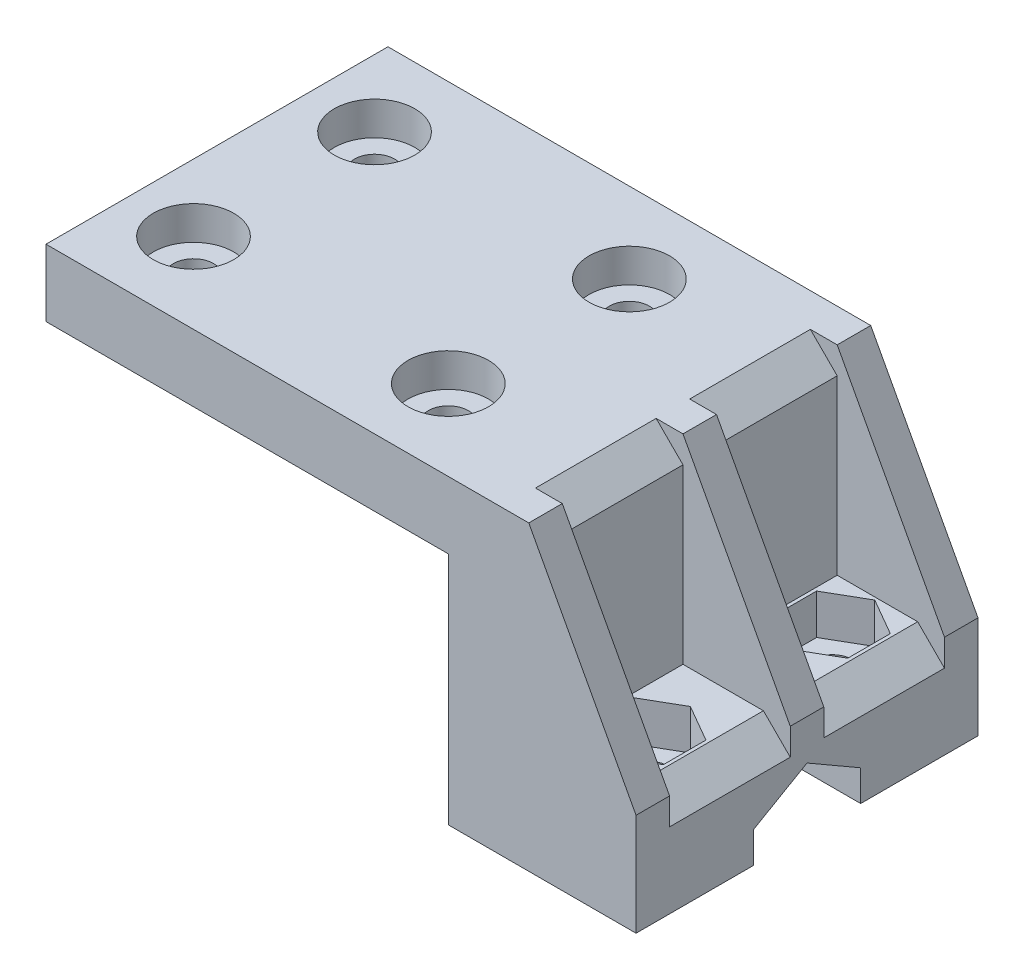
ISO-10303-21;
HEADER;
FILE_DESCRIPTION(('STEP AP214'),'2;1');
FILE_NAME('part.step','',(''),(''),'','','');
FILE_SCHEMA(('AUTOMOTIVE_DESIGN { 1 0 10303 214 1 1 1 1 }'));
ENDSEC;
DATA;
#1=APPLICATION_CONTEXT('core data for automotive mechanical design processes');
#2=APPLICATION_PROTOCOL_DEFINITION('international standard','automotive_design',2000,#1);
#3=PRODUCT_CONTEXT('',#1,'mechanical');
#4=PRODUCT('Part','Part','',(#3));
#5=PRODUCT_RELATED_PRODUCT_CATEGORY('part','',(#4));
#6=PRODUCT_DEFINITION_FORMATION('','',#4);
#7=PRODUCT_DEFINITION_CONTEXT('part definition',#1,'design');
#8=PRODUCT_DEFINITION('design','',#6,#7);
#9=PRODUCT_DEFINITION_SHAPE('','',#8);
#10=(LENGTH_UNIT() NAMED_UNIT(*) SI_UNIT(.MILLI.,.METRE.));
#11=(NAMED_UNIT(*) PLANE_ANGLE_UNIT() SI_UNIT($,.RADIAN.));
#12=(NAMED_UNIT(*) SI_UNIT($,.STERADIAN.) SOLID_ANGLE_UNIT());
#13=UNCERTAINTY_MEASURE_WITH_UNIT(LENGTH_MEASURE(1.E-05),#10,'distance_accuracy_value','');
#14=(GEOMETRIC_REPRESENTATION_CONTEXT(3) GLOBAL_UNCERTAINTY_ASSIGNED_CONTEXT((#13)) GLOBAL_UNIT_ASSIGNED_CONTEXT((#10,
#11,#12)) REPRESENTATION_CONTEXT('',''));
#15=CARTESIAN_POINT('',(0.,0.,0.));
#16=DIRECTION('',(0.,0.,1.));
#17=DIRECTION('',(1.,0.,0.));
#18=AXIS2_PLACEMENT_3D('',#15,#16,#17);
#19=CARTESIAN_POINT('',(25.,-12.5,77.1327451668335));
#20=DIRECTION('',(0.,1.,0.));
#21=DIRECTION('',(0.,0.,1.));
#22=AXIS2_PLACEMENT_3D('',#19,#20,#21);
#23=PLANE('',#22);
#24=CARTESIAN_POINT('',(34.,-12.5,8.08861931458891));
#25=DIRECTION('',(0.,-1.,0.));
#26=DIRECTION('',(0.,0.,-1.));
#27=AXIS2_PLACEMENT_3D('',#24,#25,#26);
#28=CIRCLE('',#27,1.49999999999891);
#29=CARTESIAN_POINT('',(34.,-12.5,6.58861931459));
#30=VERTEX_POINT('',#29);
#31=EDGE_CURVE('E532',#30,#30,#28,.T.);
#32=ORIENTED_EDGE('',*,*,#31,.F.);
#33=EDGE_LOOP('',(#32));
#34=FACE_BOUND('',#33,.T.);
#35=DIRECTION('',(0.,0.,-1.));
#36=VECTOR('',#35,1.);
#37=CARTESIAN_POINT('',(39.,-12.5,77.1327451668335));
#38=LINE('',#37,#36);
#39=CARTESIAN_POINT('',(39.,-12.5,10.9636193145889));
#40=VERTEX_POINT('',#39);
#41=CARTESIAN_POINT('',(39.,-12.5,2.21361931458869));
#42=VERTEX_POINT('',#41);
#43=EDGE_CURVE('E586',#40,#42,#38,.T.);
#44=ORIENTED_EDGE('',*,*,#43,.F.);
#45=DIRECTION('',(-1.,0.,0.));
#46=VECTOR('',#45,1.);
#47=CARTESIAN_POINT('',(25.,-12.5,10.9636193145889));
#48=LINE('',#47,#46);
#49=CARTESIAN_POINT('',(29.,-12.5,10.9636193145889));
#50=VERTEX_POINT('',#49);
#51=EDGE_CURVE('E336',#40,#50,#48,.T.);
#52=ORIENTED_EDGE('',*,*,#51,.T.);
#53=DIRECTION('',(0.,0.,-1.));
#54=VECTOR('',#53,1.);
#55=CARTESIAN_POINT('',(29.0000000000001,-12.5,77.1327451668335));
#56=LINE('',#55,#54);
#57=CARTESIAN_POINT('',(29.,-12.5,7.46361931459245));
#58=VERTEX_POINT('',#57);
#59=EDGE_CURVE('E668',#50,#58,#56,.T.);
#60=ORIENTED_EDGE('',*,*,#59,.T.);
#61=DIRECTION('',(-1.,0.,0.));
#62=VECTOR('',#61,1.);
#63=CARTESIAN_POINT('',(50.2132034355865,-12.5,7.46361931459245));
#64=LINE('',#63,#62);
#65=CARTESIAN_POINT('',(25.,-12.5,7.46361931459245));
#66=VERTEX_POINT('',#65);
#67=EDGE_CURVE('E345',#58,#66,#64,.T.);
#68=ORIENTED_EDGE('',*,*,#67,.T.);
#69=DIRECTION('',(0.,0.,-1.));
#70=VECTOR('',#69,1.);
#71=CARTESIAN_POINT('',(25.,-12.5,77.1327451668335));
#72=LINE('',#71,#70);
#73=CARTESIAN_POINT('',(25.,-12.5,2.21361931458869));
#74=VERTEX_POINT('',#73);
#75=EDGE_CURVE('E589',#66,#74,#72,.T.);
#76=ORIENTED_EDGE('',*,*,#75,.T.);
#77=DIRECTION('',(1.,0.,0.));
#78=VECTOR('',#77,1.);
#79=CARTESIAN_POINT('',(25.,-12.5,2.21361931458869));
#80=LINE('',#79,#78);
#81=EDGE_CURVE('E570',#74,#42,#80,.T.);
#82=ORIENTED_EDGE('',*,*,#81,.T.);
#83=EDGE_LOOP('',(#44,#52,#60,#68,#76,#82));
#84=FACE_BOUND('',#83,.T.);
#85=ADVANCED_FACE('F42',(#34,#84),#23,.F.);
#86=CARTESIAN_POINT('',(31.,-4.881197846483,77.1327451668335));
#87=DIRECTION('',(-1.,0.,0.));
#88=DIRECTION('',(0.,0.,1.));
#89=AXIS2_PLACEMENT_3D('',#86,#87,#88);
#90=PLANE('',#89);
#91=DIRECTION('',(0.,1.,0.));
#92=VECTOR('',#91,1.);
#93=CARTESIAN_POINT('',(31.,9.99999999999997,16.2136193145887));
#94=LINE('',#93,#92);
#95=CARTESIAN_POINT('',(31.,-4.88119784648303,16.2136193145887));
#96=VERTEX_POINT('',#95);
#97=CARTESIAN_POINT('',(31.,7.99999999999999,16.2136193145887));
#98=VERTEX_POINT('',#97);
#99=EDGE_CURVE('E353',#96,#98,#94,.T.);
#100=ORIENTED_EDGE('',*,*,#99,.T.);
#101=DIRECTION('',(0.,0.,1.));
#102=VECTOR('',#101,1.);
#103=CARTESIAN_POINT('',(31.,7.99999999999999,77.1327451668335));
#104=LINE('',#103,#102);
#105=CARTESIAN_POINT('',(31.,7.99999999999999,25.2136193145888));
#106=VERTEX_POINT('',#105);
#107=EDGE_CURVE('E627',#98,#106,#104,.T.);
#108=ORIENTED_EDGE('',*,*,#107,.T.);
#109=DIRECTION('',(0.,-1.,0.));
#110=VECTOR('',#109,1.);
#111=CARTESIAN_POINT('',(31.,9.9999999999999,25.2136193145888));
#112=LINE('',#111,#110);
#113=CARTESIAN_POINT('',(31.,-4.881197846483,25.2136193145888));
#114=VERTEX_POINT('',#113);
#115=EDGE_CURVE('E393',#106,#114,#112,.T.);
#116=ORIENTED_EDGE('',*,*,#115,.T.);
#117=DIRECTION('',(0.,0.,-1.));
#118=VECTOR('',#117,1.);
#119=CARTESIAN_POINT('',(31.,-4.881197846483,77.1327451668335));
#120=LINE('',#119,#118);
#121=EDGE_CURVE('E580',#114,#96,#120,.T.);
#122=ORIENTED_EDGE('',*,*,#121,.T.);
#123=EDGE_LOOP('',(#100,#108,#116,#122));
#124=FACE_BOUND('',#123,.T.);
#125=ADVANCED_FACE('F711',(#124),#90,.F.);
#126=CARTESIAN_POINT('',(39.,-4.881197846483,77.1327451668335));
#127=DIRECTION('',(0.,-1.,0.));
#128=DIRECTION('',(1.,0.,0.));
#129=AXIS2_PLACEMENT_3D('',#126,#127,#128);
#130=PLANE('',#129);
#131=DIRECTION('',(0.,0.,1.));
#132=VECTOR('',#131,1.);
#133=CARTESIAN_POINT('',(31.25,-4.881197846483,20.2509060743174));
#134=LINE('',#133,#132);
#135=CARTESIAN_POINT('',(31.25,-4.881197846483,20.2509060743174));
#136=VERTEX_POINT('',#135);
#137=CARTESIAN_POINT('',(31.25,-4.881197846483,23.4263325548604));
#138=VERTEX_POINT('',#137);
#139=EDGE_CURVE('E512',#136,#138,#134,.T.);
#140=ORIENTED_EDGE('',*,*,#139,.F.);
#141=DIRECTION('',(-0.866025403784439,0.,0.5));
#142=VECTOR('',#141,1.);
#143=CARTESIAN_POINT('',(34.,-4.881197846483,18.663192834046));
#144=LINE('',#143,#142);
#145=CARTESIAN_POINT('',(34.,-4.881197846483,18.663192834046));
#146=VERTEX_POINT('',#145);
#147=EDGE_CURVE('E459',#146,#136,#144,.T.);
#148=ORIENTED_EDGE('',*,*,#147,.F.);
#149=DIRECTION('',(-0.866025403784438,0.,-0.5));
#150=VECTOR('',#149,1.);
#151=CARTESIAN_POINT('',(36.75,-4.881197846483,20.2509060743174));
#152=LINE('',#151,#150);
#153=CARTESIAN_POINT('',(36.75,-4.881197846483,20.2509060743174));
#154=VERTEX_POINT('',#153);
#155=EDGE_CURVE('E499',#154,#146,#152,.T.);
#156=ORIENTED_EDGE('',*,*,#155,.F.);
#157=DIRECTION('',(0.,0.,-1.));
#158=VECTOR('',#157,1.);
#159=CARTESIAN_POINT('',(36.75,-4.881197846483,23.4263325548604));
#160=LINE('',#159,#158);
#161=CARTESIAN_POINT('',(36.75,-4.881197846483,23.4263325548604));
#162=VERTEX_POINT('',#161);
#163=EDGE_CURVE('E502',#162,#154,#160,.T.);
#164=ORIENTED_EDGE('',*,*,#163,.F.);
#165=DIRECTION('',(0.866025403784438,0.,-0.500000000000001));
#166=VECTOR('',#165,1.);
#167=CARTESIAN_POINT('',(34.,-4.881197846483,25.0140457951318));
#168=LINE('',#167,#166);
#169=CARTESIAN_POINT('',(34.,-4.881197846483,25.0140457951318));
#170=VERTEX_POINT('',#169);
#171=EDGE_CURVE('E506',#170,#162,#168,.T.);
#172=ORIENTED_EDGE('',*,*,#171,.F.);
#173=DIRECTION('',(0.866025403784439,0.,0.5));
#174=VECTOR('',#173,1.);
#175=CARTESIAN_POINT('',(31.25,-4.881197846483,23.4263325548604));
#176=LINE('',#175,#174);
#177=EDGE_CURVE('E509',#138,#170,#176,.T.);
#178=ORIENTED_EDGE('',*,*,#177,.F.);
#179=EDGE_LOOP('',(#140,#148,#156,#164,#172,#178));
#180=FACE_BOUND('',#179,.T.);
#181=DIRECTION('',(1.,0.,0.));
#182=VECTOR('',#181,1.);
#183=CARTESIAN_POINT('',(31.,-4.8811978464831,25.2136193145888));
#184=LINE('',#183,#182);
#185=CARTESIAN_POINT('',(37.,-4.8811978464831,25.2136193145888));
#186=VERTEX_POINT('',#185);
#187=EDGE_CURVE('E387',#114,#186,#184,.T.);
#188=ORIENTED_EDGE('',*,*,#187,.T.);
#189=DIRECTION('',(0.,0.,-1.));
#190=VECTOR('',#189,1.);
#191=CARTESIAN_POINT('',(37.,-4.881197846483,77.1327451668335));
#192=LINE('',#191,#190);
#193=CARTESIAN_POINT('',(37.,-4.88119784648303,16.2136193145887));
#194=VERTEX_POINT('',#193);
#195=EDGE_CURVE('E650',#186,#194,#192,.T.);
#196=ORIENTED_EDGE('',*,*,#195,.T.);
#197=DIRECTION('',(-1.,0.,0.));
#198=VECTOR('',#197,1.);
#199=CARTESIAN_POINT('',(31.,-4.88119784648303,16.2136193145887));
#200=LINE('',#199,#198);
#201=EDGE_CURVE('E361',#194,#96,#200,.T.);
#202=ORIENTED_EDGE('',*,*,#201,.T.);
#203=ORIENTED_EDGE('',*,*,#121,.F.);
#204=EDGE_LOOP('',(#188,#196,#202,#203));
#205=FACE_BOUND('',#204,.T.);
#206=ADVANCED_FACE('F717',(#180,#205),#130,.F.);
#207=CARTESIAN_POINT('',(19.,-12.5,8.21361931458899));
#208=DIRECTION('',(0.,1.,0.));
#209=DIRECTION('',(-1.,0.,0.));
#210=AXIS2_PLACEMENT_3D('',#207,#208,#209);
#211=CYLINDRICAL_SURFACE('',#210,1.5);
#212=CARTESIAN_POINT('',(19.,5.,8.21361931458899));
#213=DIRECTION('',(0.,1.,0.));
#214=DIRECTION('',(0.,0.,1.));
#215=AXIS2_PLACEMENT_3D('',#212,#213,#214);
#216=CIRCLE('',#215,1.5);
#217=CARTESIAN_POINT('',(19.,5.,9.71361931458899));
#218=VERTEX_POINT('',#217);
#219=EDGE_CURVE('E422',#218,#218,#216,.T.);
#220=ORIENTED_EDGE('',*,*,#219,.F.);
#221=EDGE_LOOP('',(#220));
#222=FACE_BOUND('',#221,.T.);
#223=CARTESIAN_POINT('',(19.,7.5,8.21361931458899));
#224=DIRECTION('',(0.,1.,0.));
#225=DIRECTION('',(-1.,0.,0.));
#226=AXIS2_PLACEMENT_3D('',#223,#224,#225);
#227=CIRCLE('',#226,1.5);
#228=CARTESIAN_POINT('',(17.5,7.5,8.21361931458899));
#229=VERTEX_POINT('',#228);
#230=EDGE_CURVE('E426',#229,#229,#227,.F.);
#231=ORIENTED_EDGE('',*,*,#230,.F.);
#232=EDGE_LOOP('',(#231));
#233=FACE_BOUND('',#232,.T.);
#234=ADVANCED_FACE('F779',(#222,#233),#211,.F.);
#235=CARTESIAN_POINT('',(19.,-12.5,21.713619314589));
#236=DIRECTION('',(0.,1.,0.));
#237=DIRECTION('',(-1.,0.,0.));
#238=AXIS2_PLACEMENT_3D('',#235,#236,#237);
#239=CYLINDRICAL_SURFACE('',#238,1.50000000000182);
#240=CARTESIAN_POINT('',(19.,5.,21.713619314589));
#241=DIRECTION('',(0.,1.,0.));
#242=DIRECTION('',(0.,0.,1.));
#243=AXIS2_PLACEMENT_3D('',#240,#241,#242);
#244=CIRCLE('',#243,1.50000000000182);
#245=CARTESIAN_POINT('',(19.,5.,23.2136193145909));
#246=VERTEX_POINT('',#245);
#247=EDGE_CURVE('E425',#246,#246,#244,.T.);
#248=ORIENTED_EDGE('',*,*,#247,.F.);
#249=EDGE_LOOP('',(#248));
#250=FACE_BOUND('',#249,.T.);
#251=CARTESIAN_POINT('',(19.,7.5,21.713619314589));
#252=DIRECTION('',(0.,1.,0.));
#253=DIRECTION('',(-1.,0.,0.));
#254=AXIS2_PLACEMENT_3D('',#251,#252,#253);
#255=CIRCLE('',#254,1.50000000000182);
#256=CARTESIAN_POINT('',(17.4999999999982,7.5,21.713619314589));
#257=VERTEX_POINT('',#256);
#258=EDGE_CURVE('E607',#257,#257,#255,.F.);
#259=ORIENTED_EDGE('',*,*,#258,.F.);
#260=EDGE_LOOP('',(#259));
#261=FACE_BOUND('',#260,.T.);
#262=ADVANCED_FACE('F784',(#250,#261),#239,.F.);
#263=CARTESIAN_POINT('',(0.,-12.5,21.713619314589));
#264=DIRECTION('',(0.,1.,0.));
#265=DIRECTION('',(-1.,0.,0.));
#266=AXIS2_PLACEMENT_3D('',#263,#264,#265);
#267=CYLINDRICAL_SURFACE('',#266,1.50000000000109);
#268=CARTESIAN_POINT('',(0.,5.,21.713619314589));
#269=DIRECTION('',(0.,1.,0.));
#270=DIRECTION('',(0.,0.,1.));
#271=AXIS2_PLACEMENT_3D('',#268,#269,#270);
#272=CIRCLE('',#271,1.50000000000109);
#273=CARTESIAN_POINT('',(0.,5.,23.2136193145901));
#274=VERTEX_POINT('',#273);
#275=EDGE_CURVE('E429',#274,#274,#272,.T.);
#276=ORIENTED_EDGE('',*,*,#275,.F.);
#277=EDGE_LOOP('',(#276));
#278=FACE_BOUND('',#277,.T.);
#279=CARTESIAN_POINT('',(0.,7.5,21.713619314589));
#280=DIRECTION('',(0.,1.,0.));
#281=DIRECTION('',(-1.,0.,0.));
#282=AXIS2_PLACEMENT_3D('',#279,#280,#281);
#283=CIRCLE('',#282,1.50000000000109);
#284=CARTESIAN_POINT('',(-1.50000000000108,7.5,21.713619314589));
#285=VERTEX_POINT('',#284);
#286=EDGE_CURVE('E604',#285,#285,#283,.F.);
#287=ORIENTED_EDGE('',*,*,#286,.F.);
#288=EDGE_LOOP('',(#287));
#289=FACE_BOUND('',#288,.T.);
#290=ADVANCED_FACE('F866',(#278,#289),#267,.F.);
#291=CARTESIAN_POINT('',(0.,-12.5,8.21361931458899));
#292=DIRECTION('',(0.,1.,0.));
#293=DIRECTION('',(-1.,0.,0.));
#294=AXIS2_PLACEMENT_3D('',#291,#292,#293);
#295=CYLINDRICAL_SURFACE('',#294,1.5000000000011);
#296=CARTESIAN_POINT('',(0.,5.,8.21361931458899));
#297=DIRECTION('',(0.,1.,0.));
#298=DIRECTION('',(0.,0.,1.));
#299=AXIS2_PLACEMENT_3D('',#296,#297,#298);
#300=CIRCLE('',#299,1.5000000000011);
#301=CARTESIAN_POINT('',(0.,5.,9.71361931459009));
#302=VERTEX_POINT('',#301);
#303=EDGE_CURVE('E432',#302,#302,#300,.T.);
#304=ORIENTED_EDGE('',*,*,#303,.F.);
#305=EDGE_LOOP('',(#304));
#306=FACE_BOUND('',#305,.T.);
#307=CARTESIAN_POINT('',(0.,7.5,8.21361931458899));
#308=DIRECTION('',(0.,1.,0.));
#309=DIRECTION('',(-1.,0.,0.));
#310=AXIS2_PLACEMENT_3D('',#307,#308,#309);
#311=CIRCLE('',#310,1.5000000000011);
#312=CARTESIAN_POINT('',(-1.50000000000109,7.5,8.21361931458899));
#313=VERTEX_POINT('',#312);
#314=EDGE_CURVE('E419',#313,#313,#311,.F.);
#315=ORIENTED_EDGE('',*,*,#314,.F.);
#316=EDGE_LOOP('',(#315));
#317=FACE_BOUND('',#316,.T.);
#318=ADVANCED_FACE('F738',(#306,#317),#295,.F.);
#319=CARTESIAN_POINT('',(34.,10.,21.8386193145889));
#320=DIRECTION('',(0.,-1.,0.));
#321=DIRECTION('',(0.,0.,-1.));
#322=AXIS2_PLACEMENT_3D('',#319,#320,#321);
#323=CYLINDRICAL_SURFACE('',#322,1.49999999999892);
#324=CARTESIAN_POINT('',(34.,-12.5,21.8386193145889));
#325=DIRECTION('',(0.,-1.,0.));
#326=DIRECTION('',(0.,0.,-1.));
#327=AXIS2_PLACEMENT_3D('',#324,#325,#326);
#328=CIRCLE('',#327,1.49999999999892);
#329=CARTESIAN_POINT('',(34.,-12.5,20.33861931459));
#330=VERTEX_POINT('',#329);
#331=EDGE_CURVE('E536',#330,#330,#328,.T.);
#332=ORIENTED_EDGE('',*,*,#331,.T.);
#333=EDGE_LOOP('',(#332));
#334=FACE_BOUND('',#333,.T.);
#335=CARTESIAN_POINT('',(34.,-7.881197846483,21.8386193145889));
#336=DIRECTION('',(0.,1.,0.));
#337=DIRECTION('',(0.,0.,1.));
#338=AXIS2_PLACEMENT_3D('',#335,#336,#337);
#339=CIRCLE('',#338,1.49999999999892);
#340=CARTESIAN_POINT('',(34.,-7.881197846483,23.3386193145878));
#341=VERTEX_POINT('',#340);
#342=EDGE_CURVE('E539',#341,#341,#339,.F.);
#343=ORIENTED_EDGE('',*,*,#342,.F.);
#344=EDGE_LOOP('',(#343));
#345=FACE_BOUND('',#344,.T.);
#346=ADVANCED_FACE('F734',(#334,#345),#323,.F.);
#347=CARTESIAN_POINT('',(34.,10.,8.08861931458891));
#348=DIRECTION('',(0.,-1.,0.));
#349=DIRECTION('',(0.,0.,-1.));
#350=AXIS2_PLACEMENT_3D('',#347,#348,#349);
#351=CYLINDRICAL_SURFACE('',#350,1.49999999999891);
#352=ORIENTED_EDGE('',*,*,#31,.T.);
#353=EDGE_LOOP('',(#352));
#354=FACE_BOUND('',#353,.T.);
#355=CARTESIAN_POINT('',(34.,-7.881197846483,8.08861931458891));
#356=DIRECTION('',(0.,1.,0.));
#357=DIRECTION('',(0.,0.,1.));
#358=AXIS2_PLACEMENT_3D('',#355,#356,#357);
#359=CIRCLE('',#358,1.49999999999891);
#360=CARTESIAN_POINT('',(34.,-7.881197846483,9.58861931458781));
#361=VERTEX_POINT('',#360);
#362=EDGE_CURVE('E475',#361,#361,#359,.F.);
#363=ORIENTED_EDGE('',*,*,#362,.F.);
#364=EDGE_LOOP('',(#363));
#365=FACE_BOUND('',#364,.T.);
#366=ADVANCED_FACE('F737',(#354,#365),#351,.F.);
#367=CARTESIAN_POINT('',(0.,0.,2.21361931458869));
#368=DIRECTION('',(0.,0.,1.));
#369=DIRECTION('',(1.,0.,0.));
#370=AXIS2_PLACEMENT_3D('',#367,#368,#369);
#371=PLANE('',#370);
#372=DIRECTION('',(-1.,0.,0.));
#373=VECTOR('',#372,1.);
#374=CARTESIAN_POINT('',(31.,10.,2.21361931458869));
#375=LINE('',#374,#373);
#376=CARTESIAN_POINT('',(31.,10.,2.21361931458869));
#377=VERTEX_POINT('',#376);
#378=CARTESIAN_POINT('',(-4.99999999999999,10.,2.21361931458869));
#379=VERTEX_POINT('',#378);
#380=EDGE_CURVE('E535',#377,#379,#375,.T.);
#381=ORIENTED_EDGE('',*,*,#380,.F.);
#382=DIRECTION('',(-0.473505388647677,0.880790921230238,0.));
#383=VECTOR('',#382,1.);
#384=CARTESIAN_POINT('',(39.,-4.88119784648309,2.21361931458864));
#385=LINE('',#384,#383);
#386=CARTESIAN_POINT('',(39.,-4.88119784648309,2.21361931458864));
#387=VERTEX_POINT('',#386);
#388=EDGE_CURVE('E370',#387,#377,#385,.T.);
#389=ORIENTED_EDGE('',*,*,#388,.F.);
#390=DIRECTION('',(0.,1.,0.));
#391=VECTOR('',#390,1.);
#392=CARTESIAN_POINT('',(39.,-12.5,2.21361931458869));
#393=LINE('',#392,#391);
#394=EDGE_CURVE('E573',#42,#387,#393,.T.);
#395=ORIENTED_EDGE('',*,*,#394,.F.);
#396=ORIENTED_EDGE('',*,*,#81,.F.);
#397=DIRECTION('',(0.,-1.,0.));
#398=VECTOR('',#397,1.);
#399=CARTESIAN_POINT('',(25.,5.,2.21361931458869));
#400=LINE('',#399,#398);
#401=CARTESIAN_POINT('',(25.,5.,2.21361931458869));
#402=VERTEX_POINT('',#401);
#403=EDGE_CURVE('E567',#402,#74,#400,.T.);
#404=ORIENTED_EDGE('',*,*,#403,.F.);
#405=DIRECTION('',(1.,0.,0.));
#406=VECTOR('',#405,1.);
#407=CARTESIAN_POINT('',(-4.99999999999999,5.,2.21361931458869));
#408=LINE('',#407,#406);
#409=CARTESIAN_POINT('',(-4.99999999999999,5.,2.21361931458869));
#410=VERTEX_POINT('',#409);
#411=EDGE_CURVE('E564',#410,#402,#408,.T.);
#412=ORIENTED_EDGE('',*,*,#411,.F.);
#413=DIRECTION('',(0.,-1.,0.));
#414=VECTOR('',#413,1.);
#415=CARTESIAN_POINT('',(-4.99999999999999,10.,2.21361931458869));
#416=LINE('',#415,#414);
#417=EDGE_CURVE('E561',#379,#410,#416,.T.);
#418=ORIENTED_EDGE('',*,*,#417,.F.);
#419=EDGE_LOOP('',(#381,#389,#395,#396,#404,#412,#418));
#420=FACE_BOUND('',#419,.T.);
#421=ADVANCED_FACE('F696',(#420),#371,.F.);
#422=DIRECTION('',(0.,-1.,0.));
#423=VECTOR('',#422,1.);
#424=CARTESIAN_POINT('',(31.,9.99999999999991,4.71361931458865));
#425=LINE('',#424,#423);
#426=CARTESIAN_POINT('',(31.,7.99999999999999,4.71361931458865));
#427=VERTEX_POINT('',#426);
#428=CARTESIAN_POINT('',(31.,-4.8811978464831,4.71361931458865));
#429=VERTEX_POINT('',#428);
#430=EDGE_CURVE('E374',#427,#429,#425,.T.);
#431=ORIENTED_EDGE('',*,*,#430,.F.);
#432=DIRECTION('',(0.,0.,1.));
#433=VECTOR('',#432,1.);
#434=CARTESIAN_POINT('',(31.,7.99999999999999,77.1327451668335));
#435=LINE('',#434,#433);
#436=CARTESIAN_POINT('',(31.,7.99999999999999,13.7136193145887));
#437=VERTEX_POINT('',#436);
#438=EDGE_CURVE('E629',#427,#437,#435,.T.);
#439=ORIENTED_EDGE('',*,*,#438,.T.);
#440=DIRECTION('',(0.,1.,0.));
#441=VECTOR('',#440,1.);
#442=CARTESIAN_POINT('',(31.,9.99999999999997,13.7136193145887));
#443=LINE('',#442,#441);
#444=CARTESIAN_POINT('',(31.,-4.88119784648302,13.7136193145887));
#445=VERTEX_POINT('',#444);
#446=EDGE_CURVE('E355',#445,#437,#443,.T.);
#447=ORIENTED_EDGE('',*,*,#446,.F.);
#448=EDGE_CURVE('E579',#445,#429,#120,.T.);
#449=ORIENTED_EDGE('',*,*,#448,.T.);
#450=EDGE_LOOP('',(#431,#439,#447,#449));
#451=FACE_BOUND('',#450,.T.);
#452=ADVANCED_FACE('F720',(#451),#90,.F.);
#453=DIRECTION('',(0.,0.,1.));
#454=VECTOR('',#453,1.);
#455=CARTESIAN_POINT('',(31.25,-4.881197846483,6.50090607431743));
#456=LINE('',#455,#454);
#457=CARTESIAN_POINT('',(31.25,-4.881197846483,6.50090607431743));
#458=VERTEX_POINT('',#457);
#459=CARTESIAN_POINT('',(31.25,-4.881197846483,9.67633255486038));
#460=VERTEX_POINT('',#459);
#461=EDGE_CURVE('E458',#458,#460,#456,.T.);
#462=ORIENTED_EDGE('',*,*,#461,.F.);
#463=DIRECTION('',(-0.866025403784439,0.,0.5));
#464=VECTOR('',#463,1.);
#465=CARTESIAN_POINT('',(34.,-4.881197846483,4.91319283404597));
#466=LINE('',#465,#464);
#467=CARTESIAN_POINT('',(34.,-4.881197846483,4.91319283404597));
#468=VERTEX_POINT('',#467);
#469=EDGE_CURVE('E456',#468,#458,#466,.T.);
#470=ORIENTED_EDGE('',*,*,#469,.F.);
#471=DIRECTION('',(-0.866025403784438,0.,-0.5));
#472=VECTOR('',#471,1.);
#473=CARTESIAN_POINT('',(36.75,-4.881197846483,6.50090607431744));
#474=LINE('',#473,#472);
#475=CARTESIAN_POINT('',(36.75,-4.881197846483,6.50090607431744));
#476=VERTEX_POINT('',#475);
#477=EDGE_CURVE('E440',#476,#468,#474,.T.);
#478=ORIENTED_EDGE('',*,*,#477,.F.);
#479=DIRECTION('',(0.,0.,-1.));
#480=VECTOR('',#479,1.);
#481=CARTESIAN_POINT('',(36.75,-4.881197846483,9.67633255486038));
#482=LINE('',#481,#480);
#483=CARTESIAN_POINT('',(36.75,-4.881197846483,9.67633255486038));
#484=VERTEX_POINT('',#483);
#485=EDGE_CURVE('E468',#484,#476,#482,.T.);
#486=ORIENTED_EDGE('',*,*,#485,.F.);
#487=DIRECTION('',(0.866025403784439,0.,-0.5));
#488=VECTOR('',#487,1.);
#489=CARTESIAN_POINT('',(34.,-4.881197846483,11.2640457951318));
#490=LINE('',#489,#488);
#491=CARTESIAN_POINT('',(34.,-4.881197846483,11.2640457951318));
#492=VERTEX_POINT('',#491);
#493=EDGE_CURVE('E465',#492,#484,#490,.T.);
#494=ORIENTED_EDGE('',*,*,#493,.F.);
#495=DIRECTION('',(0.866025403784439,0.,0.5));
#496=VECTOR('',#495,1.);
#497=CARTESIAN_POINT('',(31.25,-4.881197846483,9.67633255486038));
#498=LINE('',#497,#496);
#499=EDGE_CURVE('E462',#460,#492,#498,.T.);
#500=ORIENTED_EDGE('',*,*,#499,.F.);
#501=EDGE_LOOP('',(#462,#470,#478,#486,#494,#500));
#502=FACE_BOUND('',#501,.T.);
#503=DIRECTION('',(-1.,0.,0.));
#504=VECTOR('',#503,1.);
#505=CARTESIAN_POINT('',(31.,-4.88119784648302,13.7136193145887));
#506=LINE('',#505,#504);
#507=CARTESIAN_POINT('',(37.,-4.88119784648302,13.7136193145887));
#508=VERTEX_POINT('',#507);
#509=EDGE_CURVE('E352',#508,#445,#506,.T.);
#510=ORIENTED_EDGE('',*,*,#509,.F.);
#511=DIRECTION('',(0.,0.,-1.));
#512=VECTOR('',#511,1.);
#513=CARTESIAN_POINT('',(37.,-4.881197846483,77.1327451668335));
#514=LINE('',#513,#512);
#515=CARTESIAN_POINT('',(37.,-4.8811978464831,4.71361931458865));
#516=VERTEX_POINT('',#515);
#517=EDGE_CURVE('E631',#508,#516,#514,.T.);
#518=ORIENTED_EDGE('',*,*,#517,.T.);
#519=DIRECTION('',(1.,0.,0.));
#520=VECTOR('',#519,1.);
#521=CARTESIAN_POINT('',(31.,-4.8811978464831,4.71361931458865));
#522=LINE('',#521,#520);
#523=EDGE_CURVE('E371',#429,#516,#522,.T.);
#524=ORIENTED_EDGE('',*,*,#523,.F.);
#525=ORIENTED_EDGE('',*,*,#448,.F.);
#526=EDGE_LOOP('',(#510,#518,#524,#525));
#527=FACE_BOUND('',#526,.T.);
#528=ADVANCED_FACE('F731',(#502,#527),#130,.F.);
#529=CARTESIAN_POINT('',(39.,-12.5,77.1327451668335));
#530=DIRECTION('',(-1.,0.,0.));
#531=DIRECTION('',(0.,0.,1.));
#532=AXIS2_PLACEMENT_3D('',#529,#530,#531);
#533=PLANE('',#532);
#534=DIRECTION('',(0.,0.5,0.866025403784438));
#535=VECTOR('',#534,1.);
#536=CARTESIAN_POINT('',(39.,-10.1905989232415,10.9636193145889));
#537=LINE('',#536,#535);
#538=CARTESIAN_POINT('',(39.,-10.1905989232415,10.9636193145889));
#539=VERTEX_POINT('',#538);
#540=CARTESIAN_POINT('',(39.,-7.88119784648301,14.9636193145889));
#541=VERTEX_POINT('',#540);
#542=EDGE_CURVE('E313',#539,#541,#537,.T.);
#543=ORIENTED_EDGE('',*,*,#542,.F.);
#544=DIRECTION('',(0.,1.,0.));
#545=VECTOR('',#544,1.);
#546=CARTESIAN_POINT('',(39.,-14.8094010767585,10.9636193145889));
#547=LINE('',#546,#545);
#548=EDGE_CURVE('E309',#40,#539,#547,.T.);
#549=ORIENTED_EDGE('',*,*,#548,.F.);
#550=ORIENTED_EDGE('',*,*,#43,.T.);
#551=ORIENTED_EDGE('',*,*,#394,.T.);
#552=DIRECTION('',(0.,0.,-1.));
#553=VECTOR('',#552,1.);
#554=CARTESIAN_POINT('',(39.,-4.8811978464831,4.71361931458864));
#555=LINE('',#554,#553);
#556=CARTESIAN_POINT('',(39.,-4.8811978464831,4.71361931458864));
#557=VERTEX_POINT('',#556);
#558=EDGE_CURVE('E381',#557,#387,#555,.T.);
#559=ORIENTED_EDGE('',*,*,#558,.F.);
#560=DIRECTION('',(0.,-1.,0.));
#561=VECTOR('',#560,1.);
#562=CARTESIAN_POINT('',(39.,0.,4.71361931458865));
#563=LINE('',#562,#561);
#564=CARTESIAN_POINT('',(39.,-6.88119784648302,4.71361931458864));
#565=VERTEX_POINT('',#564);
#566=EDGE_CURVE('E647',#557,#565,#563,.T.);
#567=ORIENTED_EDGE('',*,*,#566,.T.);
#568=DIRECTION('',(0.,0.,1.));
#569=VECTOR('',#568,1.);
#570=CARTESIAN_POINT('',(39.,-6.88119784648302,77.1327451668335));
#571=LINE('',#570,#569);
#572=CARTESIAN_POINT('',(39.,-6.88119784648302,13.7136193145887));
#573=VERTEX_POINT('',#572);
#574=EDGE_CURVE('E644',#565,#573,#571,.T.);
#575=ORIENTED_EDGE('',*,*,#574,.T.);
#576=DIRECTION('',(0.,1.,0.));
#577=VECTOR('',#576,1.);
#578=CARTESIAN_POINT('',(39.,0.,13.7136193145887));
#579=LINE('',#578,#577);
#580=CARTESIAN_POINT('',(39.,-4.88119784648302,13.7136193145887));
#581=VERTEX_POINT('',#580);
#582=EDGE_CURVE('E642',#573,#581,#579,.T.);
#583=ORIENTED_EDGE('',*,*,#582,.T.);
#584=DIRECTION('',(0.,0.,1.));
#585=VECTOR('',#584,1.);
#586=CARTESIAN_POINT('',(39.,-4.88119784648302,13.7136193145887));
#587=LINE('',#586,#585);
#588=CARTESIAN_POINT('',(39.,-4.88119784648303,16.2136193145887));
#589=VERTEX_POINT('',#588);
#590=EDGE_CURVE('E367',#581,#589,#587,.T.);
#591=ORIENTED_EDGE('',*,*,#590,.T.);
#592=DIRECTION('',(0.,-1.,0.));
#593=VECTOR('',#592,1.);
#594=CARTESIAN_POINT('',(39.,-12.5,16.2136193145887));
#595=LINE('',#594,#593);
#596=CARTESIAN_POINT('',(39.,-6.88119784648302,16.2136193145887));
#597=VERTEX_POINT('',#596);
#598=EDGE_CURVE('E639',#589,#597,#595,.T.);
#599=ORIENTED_EDGE('',*,*,#598,.T.);
#600=DIRECTION('',(0.,0.,1.));
#601=VECTOR('',#600,1.);
#602=CARTESIAN_POINT('',(39.,-6.88119784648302,77.1327451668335));
#603=LINE('',#602,#601);
#604=CARTESIAN_POINT('',(39.,-6.88119784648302,25.2136193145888));
#605=VERTEX_POINT('',#604);
#606=EDGE_CURVE('E636',#597,#605,#603,.T.);
#607=ORIENTED_EDGE('',*,*,#606,.T.);
#608=DIRECTION('',(0.,1.,0.));
#609=VECTOR('',#608,1.);
#610=CARTESIAN_POINT('',(39.,0.,25.2136193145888));
#611=LINE('',#610,#609);
#612=CARTESIAN_POINT('',(39.,-4.881197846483,25.2136193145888));
#613=VERTEX_POINT('',#612);
#614=EDGE_CURVE('E634',#605,#613,#611,.T.);
#615=ORIENTED_EDGE('',*,*,#614,.T.);
#616=DIRECTION('',(0.,0.,-1.));
#617=VECTOR('',#616,1.);
#618=CARTESIAN_POINT('',(39.,-4.881197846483,77.1327451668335));
#619=LINE('',#618,#617);
#620=CARTESIAN_POINT('',(39.,-4.881197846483,27.7136193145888));
#621=VERTEX_POINT('',#620);
#622=EDGE_CURVE('E583',#621,#613,#619,.T.);
#623=ORIENTED_EDGE('',*,*,#622,.F.);
#624=DIRECTION('',(0.,-1.,0.));
#625=VECTOR('',#624,1.);
#626=CARTESIAN_POINT('',(39.,-12.4999999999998,27.7136193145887));
#627=LINE('',#626,#625);
#628=CARTESIAN_POINT('',(39.,-12.5,27.7136193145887));
#629=VERTEX_POINT('',#628);
#630=EDGE_CURVE('E540',#621,#629,#627,.T.);
#631=ORIENTED_EDGE('',*,*,#630,.T.);
#632=CARTESIAN_POINT('',(39.,-12.5,18.9636193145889));
#633=VERTEX_POINT('',#632);
#634=EDGE_CURVE('E587',#629,#633,#38,.T.);
#635=ORIENTED_EDGE('',*,*,#634,.T.);
#636=DIRECTION('',(0.,-1.,0.));
#637=VECTOR('',#636,1.);
#638=CARTESIAN_POINT('',(39.,-10.1905989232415,18.9636193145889));
#639=LINE('',#638,#637);
#640=CARTESIAN_POINT('',(39.,-10.1905989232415,18.9636193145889));
#641=VERTEX_POINT('',#640);
#642=EDGE_CURVE('E322',#641,#633,#639,.T.);
#643=ORIENTED_EDGE('',*,*,#642,.F.);
#644=DIRECTION('',(0.,-0.5,0.866025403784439));
#645=VECTOR('',#644,1.);
#646=CARTESIAN_POINT('',(39.,-7.88119784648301,14.9636193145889));
#647=LINE('',#646,#645);
#648=EDGE_CURVE('E303',#541,#641,#647,.T.);
#649=ORIENTED_EDGE('',*,*,#648,.F.);
#650=EDGE_LOOP('',(#543,#549,#550,#551,#559,#567,#575,#583,#591,#599,#607,#615,#623,#631,#635,
#643,#649));
#651=FACE_BOUND('',#650,.T.);
#652=ADVANCED_FACE('F320',(#651),#533,.F.);
#653=ORIENTED_EDGE('',*,*,#331,.F.);
#654=EDGE_LOOP('',(#653));
#655=FACE_BOUND('',#654,.T.);
#656=CARTESIAN_POINT('',(29.,-12.5,22.4636193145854));
#657=VERTEX_POINT('',#656);
#658=CARTESIAN_POINT('',(29.,-12.5,18.9636193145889));
#659=VERTEX_POINT('',#658);
#660=EDGE_CURVE('E51',#657,#659,#56,.T.);
#661=ORIENTED_EDGE('',*,*,#660,.T.);
#662=DIRECTION('',(1.,0.,0.));
#663=VECTOR('',#662,1.);
#664=CARTESIAN_POINT('',(25.,-12.5,18.9636193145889));
#665=LINE('',#664,#663);
#666=EDGE_CURVE('E332',#659,#633,#665,.T.);
#667=ORIENTED_EDGE('',*,*,#666,.T.);
#668=ORIENTED_EDGE('',*,*,#634,.F.);
#669=DIRECTION('',(-1.,0.,0.));
#670=VECTOR('',#669,1.);
#671=CARTESIAN_POINT('',(25.,-12.5,27.7136193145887));
#672=LINE('',#671,#670);
#673=CARTESIAN_POINT('',(25.,-12.5,27.7136193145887));
#674=VERTEX_POINT('',#673);
#675=EDGE_CURVE('E543',#629,#674,#672,.T.);
#676=ORIENTED_EDGE('',*,*,#675,.T.);
#677=CARTESIAN_POINT('',(25.,-12.5,22.4636193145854));
#678=VERTEX_POINT('',#677);
#679=EDGE_CURVE('E590',#674,#678,#72,.T.);
#680=ORIENTED_EDGE('',*,*,#679,.T.);
#681=DIRECTION('',(-1.,0.,0.));
#682=VECTOR('',#681,1.);
#683=CARTESIAN_POINT('',(50.2132034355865,-12.5,22.4636193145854));
#684=LINE('',#683,#682);
#685=EDGE_CURVE('E66',#678,#657,#684,.F.);
#686=ORIENTED_EDGE('',*,*,#685,.T.);
#687=EDGE_LOOP('',(#661,#667,#668,#676,#680,#686));
#688=FACE_BOUND('',#687,.T.);
#689=ADVANCED_FACE('F683',(#655,#688),#23,.F.);
#690=CARTESIAN_POINT('',(25.,5.,77.1327451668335));
#691=DIRECTION('',(1.,0.,0.));
#692=DIRECTION('',(0.,1.,0.));
#693=AXIS2_PLACEMENT_3D('',#690,#691,#692);
#694=PLANE('',#693);
#695=ORIENTED_EDGE('',*,*,#75,.F.);
#696=CARTESIAN_POINT('',(25.,-12.5,14.9636193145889));
#697=DIRECTION('',(-1.,0.,0.));
#698=DIRECTION('',(0.,-1.,0.));
#699=AXIS2_PLACEMENT_3D('',#696,#697,#698);
#700=CIRCLE('',#699,7.49999999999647);
#701=EDGE_CURVE('E339',#678,#66,#700,.T.);
#702=ORIENTED_EDGE('',*,*,#701,.F.);
#703=ORIENTED_EDGE('',*,*,#679,.F.);
#704=DIRECTION('',(0.,1.,0.));
#705=VECTOR('',#704,1.);
#706=CARTESIAN_POINT('',(25.,5.0000000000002,27.7136193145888));
#707=LINE('',#706,#705);
#708=CARTESIAN_POINT('',(25.,5.,27.7136193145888));
#709=VERTEX_POINT('',#708);
#710=EDGE_CURVE('E547',#674,#709,#707,.T.);
#711=ORIENTED_EDGE('',*,*,#710,.T.);
#712=DIRECTION('',(0.,0.,-1.));
#713=VECTOR('',#712,1.);
#714=CARTESIAN_POINT('',(25.,5.,77.1327451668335));
#715=LINE('',#714,#713);
#716=EDGE_CURVE('E593',#709,#402,#715,.T.);
#717=ORIENTED_EDGE('',*,*,#716,.T.);
#718=ORIENTED_EDGE('',*,*,#403,.T.);
#719=EDGE_LOOP('',(#695,#702,#703,#711,#717,#718));
#720=FACE_BOUND('',#719,.T.);
#721=ADVANCED_FACE('F690',(#720),#694,.F.);
#722=CARTESIAN_POINT('',(-4.99999999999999,5.,77.1327451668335));
#723=DIRECTION('',(0.,1.,0.));
#724=DIRECTION('',(0.,0.,1.));
#725=AXIS2_PLACEMENT_3D('',#722,#723,#724);
#726=PLANE('',#725);
#727=ORIENTED_EDGE('',*,*,#303,.T.);
#728=EDGE_LOOP('',(#727));
#729=FACE_BOUND('',#728,.T.);
#730=ORIENTED_EDGE('',*,*,#275,.T.);
#731=EDGE_LOOP('',(#730));
#732=FACE_BOUND('',#731,.T.);
#733=ORIENTED_EDGE('',*,*,#247,.T.);
#734=EDGE_LOOP('',(#733));
#735=FACE_BOUND('',#734,.T.);
#736=ORIENTED_EDGE('',*,*,#219,.T.);
#737=EDGE_LOOP('',(#736));
#738=FACE_BOUND('',#737,.T.);
#739=ORIENTED_EDGE('',*,*,#716,.F.);
#740=DIRECTION('',(-1.,0.,0.));
#741=VECTOR('',#740,1.);
#742=CARTESIAN_POINT('',(-5.00000000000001,5.,27.7136193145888));
#743=LINE('',#742,#741);
#744=CARTESIAN_POINT('',(-4.99999999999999,5.,27.7136193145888));
#745=VERTEX_POINT('',#744);
#746=EDGE_CURVE('E550',#709,#745,#743,.T.);
#747=ORIENTED_EDGE('',*,*,#746,.T.);
#748=DIRECTION('',(0.,0.,-1.));
#749=VECTOR('',#748,1.);
#750=CARTESIAN_POINT('',(-4.99999999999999,5.,77.1327451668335));
#751=LINE('',#750,#749);
#752=EDGE_CURVE('E595',#745,#410,#751,.T.);
#753=ORIENTED_EDGE('',*,*,#752,.T.);
#754=ORIENTED_EDGE('',*,*,#411,.T.);
#755=EDGE_LOOP('',(#739,#747,#753,#754));
#756=FACE_BOUND('',#755,.T.);
#757=ADVANCED_FACE('F730',(#729,#732,#735,#738,#756),#726,.F.);
#758=CARTESIAN_POINT('',(-4.99999999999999,10.,77.1327451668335));
#759=DIRECTION('',(1.,0.,0.));
#760=DIRECTION('',(0.,0.,-1.));
#761=AXIS2_PLACEMENT_3D('',#758,#759,#760);
#762=PLANE('',#761);
#763=ORIENTED_EDGE('',*,*,#752,.F.);
#764=DIRECTION('',(0.,1.,0.));
#765=VECTOR('',#764,1.);
#766=CARTESIAN_POINT('',(-4.99999999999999,10.0000000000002,27.7136193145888));
#767=LINE('',#766,#765);
#768=CARTESIAN_POINT('',(-4.99999999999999,10.,27.7136193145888));
#769=VERTEX_POINT('',#768);
#770=EDGE_CURVE('E553',#745,#769,#767,.T.);
#771=ORIENTED_EDGE('',*,*,#770,.T.);
#772=DIRECTION('',(0.,0.,-1.));
#773=VECTOR('',#772,1.);
#774=CARTESIAN_POINT('',(-4.99999999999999,10.,77.1327451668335));
#775=LINE('',#774,#773);
#776=EDGE_CURVE('E544',#769,#379,#775,.T.);
#777=ORIENTED_EDGE('',*,*,#776,.T.);
#778=ORIENTED_EDGE('',*,*,#417,.T.);
#779=EDGE_LOOP('',(#763,#771,#777,#778));
#780=FACE_BOUND('',#779,.T.);
#781=ADVANCED_FACE('F1001',(#780),#762,.F.);
#782=CARTESIAN_POINT('',(31.,10.,77.1327451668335));
#783=DIRECTION('',(0.,-1.,0.));
#784=DIRECTION('',(1.,0.,0.));
#785=AXIS2_PLACEMENT_3D('',#782,#783,#784);
#786=PLANE('',#785);
#787=CARTESIAN_POINT('',(19.,10.,8.21361931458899));
#788=DIRECTION('',(0.,1.,0.));
#789=DIRECTION('',(-1.,0.,0.));
#790=AXIS2_PLACEMENT_3D('',#787,#788,#789);
#791=CIRCLE('',#790,3.);
#792=CARTESIAN_POINT('',(16.,10.,8.21361931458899));
#793=VERTEX_POINT('',#792);
#794=EDGE_CURVE('E411',#793,#793,#791,.T.);
#795=ORIENTED_EDGE('',*,*,#794,.F.);
#796=EDGE_LOOP('',(#795));
#797=FACE_BOUND('',#796,.T.);
#798=CARTESIAN_POINT('',(19.,10.,21.713619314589));
#799=DIRECTION('',(0.,1.,0.));
#800=DIRECTION('',(-1.,0.,0.));
#801=AXIS2_PLACEMENT_3D('',#798,#799,#800);
#802=CIRCLE('',#801,3.00000000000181);
#803=CARTESIAN_POINT('',(15.9999999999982,10.,21.713619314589));
#804=VERTEX_POINT('',#803);
#805=EDGE_CURVE('E405',#804,#804,#802,.T.);
#806=ORIENTED_EDGE('',*,*,#805,.F.);
#807=EDGE_LOOP('',(#806));
#808=FACE_BOUND('',#807,.T.);
#809=CARTESIAN_POINT('',(0.,10.,21.713619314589));
#810=DIRECTION('',(0.,1.,0.));
#811=DIRECTION('',(-1.,0.,0.));
#812=AXIS2_PLACEMENT_3D('',#809,#810,#811);
#813=CIRCLE('',#812,3.00000000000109);
#814=CARTESIAN_POINT('',(-3.00000000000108,10.,21.713619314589));
#815=VERTEX_POINT('',#814);
#816=EDGE_CURVE('E398',#815,#815,#813,.T.);
#817=ORIENTED_EDGE('',*,*,#816,.F.);
#818=EDGE_LOOP('',(#817));
#819=FACE_BOUND('',#818,.T.);
#820=CARTESIAN_POINT('',(0.,10.,8.21361931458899));
#821=DIRECTION('',(0.,1.,0.));
#822=DIRECTION('',(-1.,0.,0.));
#823=AXIS2_PLACEMENT_3D('',#820,#821,#822);
#824=CIRCLE('',#823,3.0000000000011);
#825=CARTESIAN_POINT('',(-3.00000000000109,10.,8.21361931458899));
#826=VERTEX_POINT('',#825);
#827=EDGE_CURVE('E401',#826,#826,#824,.T.);
#828=ORIENTED_EDGE('',*,*,#827,.F.);
#829=EDGE_LOOP('',(#828));
#830=FACE_BOUND('',#829,.T.);
#831=DIRECTION('',(0.,0.,-1.));
#832=VECTOR('',#831,1.);
#833=CARTESIAN_POINT('',(29.,10.,77.1327451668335));
#834=LINE('',#833,#832);
#835=CARTESIAN_POINT('',(29.,10.,25.2136193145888));
#836=VERTEX_POINT('',#835);
#837=CARTESIAN_POINT('',(29.,10.,16.2136193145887));
#838=VERTEX_POINT('',#837);
#839=EDGE_CURVE('E622',#836,#838,#834,.T.);
#840=ORIENTED_EDGE('',*,*,#839,.T.);
#841=DIRECTION('',(1.,0.,0.));
#842=VECTOR('',#841,1.);
#843=CARTESIAN_POINT('',(31.,10.,16.2136193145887));
#844=LINE('',#843,#842);
#845=CARTESIAN_POINT('',(31.,9.99999999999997,16.2136193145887));
#846=VERTEX_POINT('',#845);
#847=EDGE_CURVE('E625',#838,#846,#844,.T.);
#848=ORIENTED_EDGE('',*,*,#847,.T.);
#849=DIRECTION('',(0.,0.,1.));
#850=VECTOR('',#849,1.);
#851=CARTESIAN_POINT('',(31.,9.99999999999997,13.7136193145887));
#852=LINE('',#851,#850);
#853=CARTESIAN_POINT('',(31.,10.,13.7136193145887));
#854=VERTEX_POINT('',#853);
#855=EDGE_CURVE('E358',#854,#846,#852,.T.);
#856=ORIENTED_EDGE('',*,*,#855,.F.);
#857=DIRECTION('',(-1.,0.,0.));
#858=VECTOR('',#857,1.);
#859=CARTESIAN_POINT('',(0.,10.,13.7136193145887));
#860=LINE('',#859,#858);
#861=CARTESIAN_POINT('',(29.,10.,13.7136193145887));
#862=VERTEX_POINT('',#861);
#863=EDGE_CURVE('E558',#854,#862,#860,.T.);
#864=ORIENTED_EDGE('',*,*,#863,.T.);
#865=DIRECTION('',(0.,0.,-1.));
#866=VECTOR('',#865,1.);
#867=CARTESIAN_POINT('',(29.,10.,77.1327451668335));
#868=LINE('',#867,#866);
#869=CARTESIAN_POINT('',(29.,10.,4.71361931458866));
#870=VERTEX_POINT('',#869);
#871=EDGE_CURVE('E614',#862,#870,#868,.T.);
#872=ORIENTED_EDGE('',*,*,#871,.T.);
#873=DIRECTION('',(1.,0.,0.));
#874=VECTOR('',#873,1.);
#875=CARTESIAN_POINT('',(0.,10.,4.71361931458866));
#876=LINE('',#875,#874);
#877=CARTESIAN_POINT('',(31.,9.99999999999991,4.71361931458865));
#878=VERTEX_POINT('',#877);
#879=EDGE_CURVE('E617',#870,#878,#876,.T.);
#880=ORIENTED_EDGE('',*,*,#879,.T.);
#881=DIRECTION('',(0.,0.,-1.));
#882=VECTOR('',#881,1.);
#883=CARTESIAN_POINT('',(31.,9.99999999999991,4.71361931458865));
#884=LINE('',#883,#882);
#885=EDGE_CURVE('E379',#878,#377,#884,.T.);
#886=ORIENTED_EDGE('',*,*,#885,.T.);
#887=ORIENTED_EDGE('',*,*,#380,.T.);
#888=ORIENTED_EDGE('',*,*,#776,.F.);
#889=DIRECTION('',(1.,0.,0.));
#890=VECTOR('',#889,1.);
#891=CARTESIAN_POINT('',(31.,10.,27.7136193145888));
#892=LINE('',#891,#890);
#893=CARTESIAN_POINT('',(31.,10.,27.7136193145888));
#894=VERTEX_POINT('',#893);
#895=EDGE_CURVE('E556',#769,#894,#892,.T.);
#896=ORIENTED_EDGE('',*,*,#895,.T.);
#897=DIRECTION('',(0.,0.,-1.));
#898=VECTOR('',#897,1.);
#899=CARTESIAN_POINT('',(31.,10.,77.1327451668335));
#900=LINE('',#899,#898);
#901=CARTESIAN_POINT('',(31.,10.,25.2136193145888));
#902=VERTEX_POINT('',#901);
#903=EDGE_CURVE('E576',#894,#902,#900,.T.);
#904=ORIENTED_EDGE('',*,*,#903,.T.);
#905=DIRECTION('',(-1.,0.,0.));
#906=VECTOR('',#905,1.);
#907=CARTESIAN_POINT('',(0.,10.,25.2136193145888));
#908=LINE('',#907,#906);
#909=EDGE_CURVE('E619',#902,#836,#908,.T.);
#910=ORIENTED_EDGE('',*,*,#909,.T.);
#911=EDGE_LOOP('',(#840,#848,#856,#864,#872,#880,#886,#887,#888,#896,#904,#910));
#912=FACE_BOUND('',#911,.T.);
#913=ADVANCED_FACE('F767',(#797,#808,#819,#830,#912),#786,.F.);
#914=CARTESIAN_POINT('',(39.,-13.0000000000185,27.7136193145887));
#915=DIRECTION('',(0.,0.,-1.));
#916=DIRECTION('',(-1.,0.,0.));
#917=AXIS2_PLACEMENT_3D('',#914,#915,#916);
#918=PLANE('',#917);
#919=ORIENTED_EDGE('',*,*,#630,.F.);
#920=DIRECTION('',(-0.473505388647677,0.880790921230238,0.));
#921=VECTOR('',#920,1.);
#922=CARTESIAN_POINT('',(39.,-4.8811978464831,27.7136193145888));
#923=LINE('',#922,#921);
#924=EDGE_CURVE('E384',#621,#894,#923,.T.);
#925=ORIENTED_EDGE('',*,*,#924,.T.);
#926=ORIENTED_EDGE('',*,*,#895,.F.);
#927=ORIENTED_EDGE('',*,*,#770,.F.);
#928=ORIENTED_EDGE('',*,*,#746,.F.);
#929=ORIENTED_EDGE('',*,*,#710,.F.);
#930=ORIENTED_EDGE('',*,*,#675,.F.);
#931=EDGE_LOOP('',(#919,#925,#926,#927,#928,#929,#930));
#932=FACE_BOUND('',#931,.T.);
#933=ADVANCED_FACE('F687',(#932),#918,.F.);
#934=CARTESIAN_POINT('',(0.,-7.881197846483,0.));
#935=DIRECTION('',(0.,1.,0.));
#936=DIRECTION('',(0.,0.,1.));
#937=AXIS2_PLACEMENT_3D('',#934,#935,#936);
#938=PLANE('',#937);
#939=DIRECTION('',(-0.866025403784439,0.,0.5));
#940=VECTOR('',#939,1.);
#941=CARTESIAN_POINT('',(34.,-7.881197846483,4.91319283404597));
#942=LINE('',#941,#940);
#943=CARTESIAN_POINT('',(34.,-7.881197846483,4.91319283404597));
#944=VERTEX_POINT('',#943);
#945=CARTESIAN_POINT('',(31.25,-7.881197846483,6.50090607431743));
#946=VERTEX_POINT('',#945);
#947=EDGE_CURVE('E436',#944,#946,#942,.T.);
#948=ORIENTED_EDGE('',*,*,#947,.T.);
#949=DIRECTION('',(0.,0.,1.));
#950=VECTOR('',#949,1.);
#951=CARTESIAN_POINT('',(31.25,-7.881197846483,6.50090607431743));
#952=LINE('',#951,#950);
#953=CARTESIAN_POINT('',(31.25,-7.881197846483,9.67633255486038));
#954=VERTEX_POINT('',#953);
#955=EDGE_CURVE('E439',#946,#954,#952,.T.);
#956=ORIENTED_EDGE('',*,*,#955,.T.);
#957=DIRECTION('',(0.866025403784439,0.,0.5));
#958=VECTOR('',#957,1.);
#959=CARTESIAN_POINT('',(31.25,-7.881197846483,9.67633255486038));
#960=LINE('',#959,#958);
#961=CARTESIAN_POINT('',(34.,-7.881197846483,11.2640457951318));
#962=VERTEX_POINT('',#961);
#963=EDGE_CURVE('E443',#954,#962,#960,.T.);
#964=ORIENTED_EDGE('',*,*,#963,.T.);
#965=DIRECTION('',(0.866025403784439,0.,-0.5));
#966=VECTOR('',#965,1.);
#967=CARTESIAN_POINT('',(34.,-7.881197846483,11.2640457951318));
#968=LINE('',#967,#966);
#969=CARTESIAN_POINT('',(36.75,-7.881197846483,9.67633255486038));
#970=VERTEX_POINT('',#969);
#971=EDGE_CURVE('E446',#962,#970,#968,.T.);
#972=ORIENTED_EDGE('',*,*,#971,.T.);
#973=DIRECTION('',(0.,0.,-1.));
#974=VECTOR('',#973,1.);
#975=CARTESIAN_POINT('',(36.75,-7.881197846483,9.67633255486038));
#976=LINE('',#975,#974);
#977=CARTESIAN_POINT('',(36.75,-7.881197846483,6.50090607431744));
#978=VERTEX_POINT('',#977);
#979=EDGE_CURVE('E449',#970,#978,#976,.T.);
#980=ORIENTED_EDGE('',*,*,#979,.T.);
#981=DIRECTION('',(-0.866025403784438,0.,-0.5));
#982=VECTOR('',#981,1.);
#983=CARTESIAN_POINT('',(36.75,-7.881197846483,6.50090607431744));
#984=LINE('',#983,#982);
#985=EDGE_CURVE('E452',#978,#944,#984,.T.);
#986=ORIENTED_EDGE('',*,*,#985,.T.);
#987=EDGE_LOOP('',(#948,#956,#964,#972,#980,#986));
#988=FACE_BOUND('',#987,.T.);
#989=ORIENTED_EDGE('',*,*,#362,.T.);
#990=EDGE_LOOP('',(#989));
#991=FACE_BOUND('',#990,.T.);
#992=ADVANCED_FACE('F766',(#988,#991),#938,.T.);
#993=CARTESIAN_POINT('',(34.,-7.881197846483,4.91319283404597));
#994=DIRECTION('',(-0.5,0.,-0.866025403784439));
#995=DIRECTION('',(-0.866025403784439,0.,0.5));
#996=AXIS2_PLACEMENT_3D('',#993,#994,#995);
#997=PLANE('',#996);
#998=ORIENTED_EDGE('',*,*,#469,.T.);
#999=DIRECTION('',(0.,1.,0.));
#1000=VECTOR('',#999,1.);
#1001=CARTESIAN_POINT('',(31.25,-7.881197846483,6.50090607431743));
#1002=LINE('',#1001,#1000);
#1003=EDGE_CURVE('E455',#946,#458,#1002,.T.);
#1004=ORIENTED_EDGE('',*,*,#1003,.F.);
#1005=ORIENTED_EDGE('',*,*,#947,.F.);
#1006=DIRECTION('',(0.,1.,0.));
#1007=VECTOR('',#1006,1.);
#1008=CARTESIAN_POINT('',(34.,-7.881197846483,4.91319283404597));
#1009=LINE('',#1008,#1007);
#1010=EDGE_CURVE('E473',#944,#468,#1009,.T.);
#1011=ORIENTED_EDGE('',*,*,#1010,.T.);
#1012=EDGE_LOOP('',(#998,#1004,#1005,#1011));
#1013=FACE_BOUND('',#1012,.T.);
#1014=ADVANCED_FACE('F876',(#1013),#997,.F.);
#1015=CARTESIAN_POINT('',(36.75,-7.881197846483,6.50090607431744));
#1016=DIRECTION('',(0.5,0.,-0.866025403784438));
#1017=DIRECTION('',(-0.866025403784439,0.,-0.5));
#1018=AXIS2_PLACEMENT_3D('',#1015,#1016,#1017);
#1019=PLANE('',#1018);
#1020=ORIENTED_EDGE('',*,*,#477,.T.);
#1021=ORIENTED_EDGE('',*,*,#1010,.F.);
#1022=ORIENTED_EDGE('',*,*,#985,.F.);
#1023=DIRECTION('',(0.,1.,0.));
#1024=VECTOR('',#1023,1.);
#1025=CARTESIAN_POINT('',(36.75,-7.881197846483,6.50090607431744));
#1026=LINE('',#1025,#1024);
#1027=EDGE_CURVE('E476',#978,#476,#1026,.T.);
#1028=ORIENTED_EDGE('',*,*,#1027,.T.);
#1029=EDGE_LOOP('',(#1020,#1021,#1022,#1028));
#1030=FACE_BOUND('',#1029,.T.);
#1031=ADVANCED_FACE('F878',(#1030),#1019,.F.);
#1032=CARTESIAN_POINT('',(36.75,-7.881197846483,9.67633255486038));
#1033=DIRECTION('',(1.,0.,0.));
#1034=DIRECTION('',(0.,1.,0.));
#1035=AXIS2_PLACEMENT_3D('',#1032,#1033,#1034);
#1036=PLANE('',#1035);
#1037=ORIENTED_EDGE('',*,*,#485,.T.);
#1038=ORIENTED_EDGE('',*,*,#1027,.F.);
#1039=ORIENTED_EDGE('',*,*,#979,.F.);
#1040=DIRECTION('',(0.,1.,0.));
#1041=VECTOR('',#1040,1.);
#1042=CARTESIAN_POINT('',(36.75,-7.881197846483,9.67633255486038));
#1043=LINE('',#1042,#1041);
#1044=EDGE_CURVE('E478',#970,#484,#1043,.T.);
#1045=ORIENTED_EDGE('',*,*,#1044,.T.);
#1046=EDGE_LOOP('',(#1037,#1038,#1039,#1045));
#1047=FACE_BOUND('',#1046,.T.);
#1048=ADVANCED_FACE('F881',(#1047),#1036,.F.);
#1049=CARTESIAN_POINT('',(34.,-7.881197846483,11.2640457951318));
#1050=DIRECTION('',(0.5,0.,0.866025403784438));
#1051=DIRECTION('',(0.866025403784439,0.,-0.5));
#1052=AXIS2_PLACEMENT_3D('',#1049,#1050,#1051);
#1053=PLANE('',#1052);
#1054=ORIENTED_EDGE('',*,*,#493,.T.);
#1055=ORIENTED_EDGE('',*,*,#1044,.F.);
#1056=ORIENTED_EDGE('',*,*,#971,.F.);
#1057=DIRECTION('',(0.,1.,0.));
#1058=VECTOR('',#1057,1.);
#1059=CARTESIAN_POINT('',(34.,-7.881197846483,11.2640457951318));
#1060=LINE('',#1059,#1058);
#1061=EDGE_CURVE('E480',#962,#492,#1060,.T.);
#1062=ORIENTED_EDGE('',*,*,#1061,.T.);
#1063=EDGE_LOOP('',(#1054,#1055,#1056,#1062));
#1064=FACE_BOUND('',#1063,.T.);
#1065=ADVANCED_FACE('F885',(#1064),#1053,.F.);
#1066=CARTESIAN_POINT('',(31.25,-7.881197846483,9.67633255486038));
#1067=DIRECTION('',(-0.5,0.,0.866025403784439));
#1068=DIRECTION('',(0.866025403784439,0.,0.5));
#1069=AXIS2_PLACEMENT_3D('',#1066,#1067,#1068);
#1070=PLANE('',#1069);
#1071=ORIENTED_EDGE('',*,*,#499,.T.);
#1072=ORIENTED_EDGE('',*,*,#1061,.F.);
#1073=ORIENTED_EDGE('',*,*,#963,.F.);
#1074=DIRECTION('',(0.,1.,0.));
#1075=VECTOR('',#1074,1.);
#1076=CARTESIAN_POINT('',(31.25,-7.881197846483,9.67633255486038));
#1077=LINE('',#1076,#1075);
#1078=EDGE_CURVE('E482',#954,#460,#1077,.T.);
#1079=ORIENTED_EDGE('',*,*,#1078,.T.);
#1080=EDGE_LOOP('',(#1071,#1072,#1073,#1079));
#1081=FACE_BOUND('',#1080,.T.);
#1082=ADVANCED_FACE('F755',(#1081),#1070,.F.);
#1083=CARTESIAN_POINT('',(31.25,-7.881197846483,6.50090607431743));
#1084=DIRECTION('',(-1.,0.,0.));
#1085=DIRECTION('',(0.,-1.,0.));
#1086=AXIS2_PLACEMENT_3D('',#1083,#1084,#1085);
#1087=PLANE('',#1086);
#1088=ORIENTED_EDGE('',*,*,#461,.T.);
#1089=ORIENTED_EDGE('',*,*,#1078,.F.);
#1090=ORIENTED_EDGE('',*,*,#955,.F.);
#1091=ORIENTED_EDGE('',*,*,#1003,.T.);
#1092=EDGE_LOOP('',(#1088,#1089,#1090,#1091));
#1093=FACE_BOUND('',#1092,.T.);
#1094=ADVANCED_FACE('F745',(#1093),#1087,.F.);
#1095=CARTESIAN_POINT('',(0.,-7.881197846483,0.));
#1096=DIRECTION('',(0.,1.,0.));
#1097=DIRECTION('',(0.,0.,1.));
#1098=AXIS2_PLACEMENT_3D('',#1095,#1096,#1097);
#1099=PLANE('',#1098);
#1100=DIRECTION('',(-0.866025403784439,0.,0.5));
#1101=VECTOR('',#1100,1.);
#1102=CARTESIAN_POINT('',(34.,-7.881197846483,18.663192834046));
#1103=LINE('',#1102,#1101);
#1104=CARTESIAN_POINT('',(34.,-7.881197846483,18.663192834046));
#1105=VERTEX_POINT('',#1104);
#1106=CARTESIAN_POINT('',(31.25,-7.881197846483,20.2509060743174));
#1107=VERTEX_POINT('',#1106);
#1108=EDGE_CURVE('E503',#1105,#1107,#1103,.T.);
#1109=ORIENTED_EDGE('',*,*,#1108,.T.);
#1110=DIRECTION('',(0.,0.,1.));
#1111=VECTOR('',#1110,1.);
#1112=CARTESIAN_POINT('',(31.25,-7.881197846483,20.2509060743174));
#1113=LINE('',#1112,#1111);
#1114=CARTESIAN_POINT('',(31.25,-7.881197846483,23.4263325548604));
#1115=VERTEX_POINT('',#1114);
#1116=EDGE_CURVE('E527',#1107,#1115,#1113,.T.);
#1117=ORIENTED_EDGE('',*,*,#1116,.T.);
#1118=DIRECTION('',(0.866025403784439,0.,0.5));
#1119=VECTOR('',#1118,1.);
#1120=CARTESIAN_POINT('',(31.25,-7.881197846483,23.4263325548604));
#1121=LINE('',#1120,#1119);
#1122=CARTESIAN_POINT('',(34.,-7.881197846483,25.0140457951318));
#1123=VERTEX_POINT('',#1122);
#1124=EDGE_CURVE('E524',#1115,#1123,#1121,.T.);
#1125=ORIENTED_EDGE('',*,*,#1124,.T.);
#1126=DIRECTION('',(0.866025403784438,0.,-0.500000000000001));
#1127=VECTOR('',#1126,1.);
#1128=CARTESIAN_POINT('',(34.,-7.881197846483,25.0140457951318));
#1129=LINE('',#1128,#1127);
#1130=CARTESIAN_POINT('',(36.75,-7.881197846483,23.4263325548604));
#1131=VERTEX_POINT('',#1130);
#1132=EDGE_CURVE('E521',#1123,#1131,#1129,.T.);
#1133=ORIENTED_EDGE('',*,*,#1132,.T.);
#1134=DIRECTION('',(0.,0.,-1.));
#1135=VECTOR('',#1134,1.);
#1136=CARTESIAN_POINT('',(36.75,-7.881197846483,23.4263325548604));
#1137=LINE('',#1136,#1135);
#1138=CARTESIAN_POINT('',(36.75,-7.881197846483,20.2509060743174));
#1139=VERTEX_POINT('',#1138);
#1140=EDGE_CURVE('E518',#1131,#1139,#1137,.T.);
#1141=ORIENTED_EDGE('',*,*,#1140,.T.);
#1142=DIRECTION('',(-0.866025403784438,0.,-0.5));
#1143=VECTOR('',#1142,1.);
#1144=CARTESIAN_POINT('',(36.75,-7.881197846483,20.2509060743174));
#1145=LINE('',#1144,#1143);
#1146=EDGE_CURVE('E489',#1139,#1105,#1145,.T.);
#1147=ORIENTED_EDGE('',*,*,#1146,.T.);
#1148=EDGE_LOOP('',(#1109,#1117,#1125,#1133,#1141,#1147));
#1149=FACE_BOUND('',#1148,.T.);
#1150=ORIENTED_EDGE('',*,*,#342,.T.);
#1151=EDGE_LOOP('',(#1150));
#1152=FACE_BOUND('',#1151,.T.);
#1153=ADVANCED_FACE('F742',(#1149,#1152),#1099,.T.);
#1154=CARTESIAN_POINT('',(34.,-7.881197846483,18.663192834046));
#1155=DIRECTION('',(-0.5,0.,-0.866025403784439));
#1156=DIRECTION('',(-0.866025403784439,0.,0.5));
#1157=AXIS2_PLACEMENT_3D('',#1154,#1155,#1156);
#1158=PLANE('',#1157);
#1159=ORIENTED_EDGE('',*,*,#147,.T.);
#1160=DIRECTION('',(0.,1.,0.));
#1161=VECTOR('',#1160,1.);
#1162=CARTESIAN_POINT('',(31.25,-7.881197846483,20.2509060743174));
#1163=LINE('',#1162,#1161);
#1164=EDGE_CURVE('E486',#1107,#136,#1163,.T.);
#1165=ORIENTED_EDGE('',*,*,#1164,.F.);
#1166=ORIENTED_EDGE('',*,*,#1108,.F.);
#1167=DIRECTION('',(0.,1.,0.));
#1168=VECTOR('',#1167,1.);
#1169=CARTESIAN_POINT('',(34.,-7.881197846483,18.663192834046));
#1170=LINE('',#1169,#1168);
#1171=EDGE_CURVE('E435',#1105,#146,#1170,.T.);
#1172=ORIENTED_EDGE('',*,*,#1171,.T.);
#1173=EDGE_LOOP('',(#1159,#1165,#1166,#1172));
#1174=FACE_BOUND('',#1173,.T.);
#1175=ADVANCED_FACE('F744',(#1174),#1158,.F.);
#1176=CARTESIAN_POINT('',(36.75,-7.881197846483,20.2509060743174));
#1177=DIRECTION('',(0.5,0.,-0.866025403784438));
#1178=DIRECTION('',(-0.866025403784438,0.,-0.5));
#1179=AXIS2_PLACEMENT_3D('',#1176,#1177,#1178);
#1180=PLANE('',#1179);
#1181=ORIENTED_EDGE('',*,*,#155,.T.);
#1182=ORIENTED_EDGE('',*,*,#1171,.F.);
#1183=ORIENTED_EDGE('',*,*,#1146,.F.);
#1184=DIRECTION('',(0.,1.,0.));
#1185=VECTOR('',#1184,1.);
#1186=CARTESIAN_POINT('',(36.75,-7.881197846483,20.2509060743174));
#1187=LINE('',#1186,#1185);
#1188=EDGE_CURVE('E496',#1139,#154,#1187,.T.);
#1189=ORIENTED_EDGE('',*,*,#1188,.T.);
#1190=EDGE_LOOP('',(#1181,#1182,#1183,#1189));
#1191=FACE_BOUND('',#1190,.T.);
#1192=ADVANCED_FACE('F752',(#1191),#1180,.F.);
#1193=CARTESIAN_POINT('',(36.75,-7.881197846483,23.4263325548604));
#1194=DIRECTION('',(1.,0.,0.));
#1195=DIRECTION('',(0.,1.,0.));
#1196=AXIS2_PLACEMENT_3D('',#1193,#1194,#1195);
#1197=PLANE('',#1196);
#1198=ORIENTED_EDGE('',*,*,#163,.T.);
#1199=ORIENTED_EDGE('',*,*,#1188,.F.);
#1200=ORIENTED_EDGE('',*,*,#1140,.F.);
#1201=DIRECTION('',(0.,1.,0.));
#1202=VECTOR('',#1201,1.);
#1203=CARTESIAN_POINT('',(36.75,-7.881197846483,23.4263325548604));
#1204=LINE('',#1203,#1202);
#1205=EDGE_CURVE('E494',#1131,#162,#1204,.T.);
#1206=ORIENTED_EDGE('',*,*,#1205,.T.);
#1207=EDGE_LOOP('',(#1198,#1199,#1200,#1206));
#1208=FACE_BOUND('',#1207,.T.);
#1209=ADVANCED_FACE('F905',(#1208),#1197,.F.);
#1210=CARTESIAN_POINT('',(34.,-7.881197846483,25.0140457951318));
#1211=DIRECTION('',(0.500000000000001,0.,0.866025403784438));
#1212=DIRECTION('',(0.866025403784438,0.,-0.500000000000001));
#1213=AXIS2_PLACEMENT_3D('',#1210,#1211,#1212);
#1214=PLANE('',#1213);
#1215=ORIENTED_EDGE('',*,*,#171,.T.);
#1216=ORIENTED_EDGE('',*,*,#1205,.F.);
#1217=ORIENTED_EDGE('',*,*,#1132,.F.);
#1218=DIRECTION('',(0.,1.,0.));
#1219=VECTOR('',#1218,1.);
#1220=CARTESIAN_POINT('',(34.,-7.881197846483,25.0140457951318));
#1221=LINE('',#1220,#1219);
#1222=EDGE_CURVE('E492',#1123,#170,#1221,.T.);
#1223=ORIENTED_EDGE('',*,*,#1222,.T.);
#1224=EDGE_LOOP('',(#1215,#1216,#1217,#1223));
#1225=FACE_BOUND('',#1224,.T.);
#1226=ADVANCED_FACE('F902',(#1225),#1214,.F.);
#1227=CARTESIAN_POINT('',(31.25,-7.881197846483,23.4263325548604));
#1228=DIRECTION('',(-0.5,0.,0.866025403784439));
#1229=DIRECTION('',(0.866025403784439,0.,0.5));
#1230=AXIS2_PLACEMENT_3D('',#1227,#1228,#1229);
#1231=PLANE('',#1230);
#1232=ORIENTED_EDGE('',*,*,#177,.T.);
#1233=ORIENTED_EDGE('',*,*,#1222,.F.);
#1234=ORIENTED_EDGE('',*,*,#1124,.F.);
#1235=DIRECTION('',(0.,1.,0.));
#1236=VECTOR('',#1235,1.);
#1237=CARTESIAN_POINT('',(31.25,-7.881197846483,23.4263325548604));
#1238=LINE('',#1237,#1236);
#1239=EDGE_CURVE('E490',#1115,#138,#1238,.T.);
#1240=ORIENTED_EDGE('',*,*,#1239,.T.);
#1241=EDGE_LOOP('',(#1232,#1233,#1234,#1240));
#1242=FACE_BOUND('',#1241,.T.);
#1243=ADVANCED_FACE('F898',(#1242),#1231,.F.);
#1244=CARTESIAN_POINT('',(31.25,-7.881197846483,20.2509060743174));
#1245=DIRECTION('',(-1.,0.,0.));
#1246=DIRECTION('',(0.,-1.,0.));
#1247=AXIS2_PLACEMENT_3D('',#1244,#1245,#1246);
#1248=PLANE('',#1247);
#1249=ORIENTED_EDGE('',*,*,#139,.T.);
#1250=ORIENTED_EDGE('',*,*,#1239,.F.);
#1251=ORIENTED_EDGE('',*,*,#1116,.F.);
#1252=ORIENTED_EDGE('',*,*,#1164,.T.);
#1253=EDGE_LOOP('',(#1249,#1250,#1251,#1252));
#1254=FACE_BOUND('',#1253,.T.);
#1255=ADVANCED_FACE('F859',(#1254),#1248,.F.);
#1256=CARTESIAN_POINT('',(0.,7.5,8.21361931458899));
#1257=DIRECTION('',(0.,1.,0.));
#1258=DIRECTION('',(-1.,0.,0.));
#1259=AXIS2_PLACEMENT_3D('',#1256,#1257,#1258);
#1260=PLANE('',#1259);
#1261=CARTESIAN_POINT('',(0.,7.5,8.21361931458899));
#1262=DIRECTION('',(0.,1.,0.));
#1263=DIRECTION('',(-1.,0.,0.));
#1264=AXIS2_PLACEMENT_3D('',#1261,#1262,#1263);
#1265=CIRCLE('',#1264,3.0000000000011);
#1266=CARTESIAN_POINT('',(-3.00000000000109,7.5,8.21361931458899));
#1267=VERTEX_POINT('',#1266);
#1268=EDGE_CURVE('E416',#1267,#1267,#1265,.T.);
#1269=ORIENTED_EDGE('',*,*,#1268,.T.);
#1270=EDGE_LOOP('',(#1269));
#1271=FACE_BOUND('',#1270,.T.);
#1272=ORIENTED_EDGE('',*,*,#314,.T.);
#1273=EDGE_LOOP('',(#1272));
#1274=FACE_BOUND('',#1273,.T.);
#1275=ADVANCED_FACE('F856',(#1271,#1274),#1260,.T.);
#1276=CARTESIAN_POINT('',(0.,7.5,8.21361931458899));
#1277=DIRECTION('',(0.,1.,0.));
#1278=DIRECTION('',(-1.,0.,0.));
#1279=AXIS2_PLACEMENT_3D('',#1276,#1277,#1278);
#1280=CYLINDRICAL_SURFACE('',#1279,3.0000000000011);
#1281=ORIENTED_EDGE('',*,*,#1268,.F.);
#1282=EDGE_LOOP('',(#1281));
#1283=FACE_BOUND('',#1282,.T.);
#1284=ORIENTED_EDGE('',*,*,#827,.T.);
#1285=EDGE_LOOP('',(#1284));
#1286=FACE_BOUND('',#1285,.T.);
#1287=ADVANCED_FACE('F844',(#1283,#1286),#1280,.F.);
#1288=CARTESIAN_POINT('',(0.,7.5,21.713619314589));
#1289=DIRECTION('',(0.,1.,0.));
#1290=DIRECTION('',(-1.,0.,0.));
#1291=AXIS2_PLACEMENT_3D('',#1288,#1289,#1290);
#1292=PLANE('',#1291);
#1293=CARTESIAN_POINT('',(0.,7.5,21.713619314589));
#1294=DIRECTION('',(0.,1.,0.));
#1295=DIRECTION('',(-1.,0.,0.));
#1296=AXIS2_PLACEMENT_3D('',#1293,#1294,#1295);
#1297=CIRCLE('',#1296,3.00000000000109);
#1298=CARTESIAN_POINT('',(-3.00000000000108,7.5,21.713619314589));
#1299=VERTEX_POINT('',#1298);
#1300=EDGE_CURVE('E402',#1299,#1299,#1297,.T.);
#1301=ORIENTED_EDGE('',*,*,#1300,.T.);
#1302=EDGE_LOOP('',(#1301));
#1303=FACE_BOUND('',#1302,.T.);
#1304=ORIENTED_EDGE('',*,*,#286,.T.);
#1305=EDGE_LOOP('',(#1304));
#1306=FACE_BOUND('',#1305,.T.);
#1307=ADVANCED_FACE('F840',(#1303,#1306),#1292,.T.);
#1308=CARTESIAN_POINT('',(0.,7.5,21.713619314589));
#1309=DIRECTION('',(0.,1.,0.));
#1310=DIRECTION('',(-1.,0.,0.));
#1311=AXIS2_PLACEMENT_3D('',#1308,#1309,#1310);
#1312=CYLINDRICAL_SURFACE('',#1311,3.00000000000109);
#1313=ORIENTED_EDGE('',*,*,#1300,.F.);
#1314=EDGE_LOOP('',(#1313));
#1315=FACE_BOUND('',#1314,.T.);
#1316=ORIENTED_EDGE('',*,*,#816,.T.);
#1317=EDGE_LOOP('',(#1316));
#1318=FACE_BOUND('',#1317,.T.);
#1319=ADVANCED_FACE('F836',(#1315,#1318),#1312,.F.);
#1320=CARTESIAN_POINT('',(19.,7.5,21.713619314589));
#1321=DIRECTION('',(0.,1.,0.));
#1322=DIRECTION('',(-1.,0.,0.));
#1323=AXIS2_PLACEMENT_3D('',#1320,#1321,#1322);
#1324=PLANE('',#1323);
#1325=CARTESIAN_POINT('',(19.,7.5,21.713619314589));
#1326=DIRECTION('',(0.,1.,0.));
#1327=DIRECTION('',(-1.,0.,0.));
#1328=AXIS2_PLACEMENT_3D('',#1325,#1326,#1327);
#1329=CIRCLE('',#1328,3.00000000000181);
#1330=CARTESIAN_POINT('',(15.9999999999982,7.5,21.713619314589));
#1331=VERTEX_POINT('',#1330);
#1332=EDGE_CURVE('E408',#1331,#1331,#1329,.T.);
#1333=ORIENTED_EDGE('',*,*,#1332,.T.);
#1334=EDGE_LOOP('',(#1333));
#1335=FACE_BOUND('',#1334,.T.);
#1336=ORIENTED_EDGE('',*,*,#258,.T.);
#1337=EDGE_LOOP('',(#1336));
#1338=FACE_BOUND('',#1337,.T.);
#1339=ADVANCED_FACE('F839',(#1335,#1338),#1324,.T.);
#1340=CARTESIAN_POINT('',(19.,7.5,21.713619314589));
#1341=DIRECTION('',(0.,1.,0.));
#1342=DIRECTION('',(-1.,0.,0.));
#1343=AXIS2_PLACEMENT_3D('',#1340,#1341,#1342);
#1344=CYLINDRICAL_SURFACE('',#1343,3.00000000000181);
#1345=ORIENTED_EDGE('',*,*,#1332,.F.);
#1346=EDGE_LOOP('',(#1345));
#1347=FACE_BOUND('',#1346,.T.);
#1348=ORIENTED_EDGE('',*,*,#805,.T.);
#1349=EDGE_LOOP('',(#1348));
#1350=FACE_BOUND('',#1349,.T.);
#1351=ADVANCED_FACE('F846',(#1347,#1350),#1344,.F.);
#1352=CARTESIAN_POINT('',(19.,7.5,8.21361931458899));
#1353=DIRECTION('',(0.,1.,0.));
#1354=DIRECTION('',(-1.,0.,0.));
#1355=AXIS2_PLACEMENT_3D('',#1352,#1353,#1354);
#1356=PLANE('',#1355);
#1357=CARTESIAN_POINT('',(19.,7.5,8.21361931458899));
#1358=DIRECTION('',(0.,1.,0.));
#1359=DIRECTION('',(-1.,0.,0.));
#1360=AXIS2_PLACEMENT_3D('',#1357,#1358,#1359);
#1361=CIRCLE('',#1360,3.);
#1362=CARTESIAN_POINT('',(16.,7.5,8.21361931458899));
#1363=VERTEX_POINT('',#1362);
#1364=EDGE_CURVE('E395',#1363,#1363,#1361,.T.);
#1365=ORIENTED_EDGE('',*,*,#1364,.T.);
#1366=EDGE_LOOP('',(#1365));
#1367=FACE_BOUND('',#1366,.T.);
#1368=ORIENTED_EDGE('',*,*,#230,.T.);
#1369=EDGE_LOOP('',(#1368));
#1370=FACE_BOUND('',#1369,.T.);
#1371=ADVANCED_FACE('F831',(#1367,#1370),#1356,.T.);
#1372=CARTESIAN_POINT('',(19.,7.5,8.21361931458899));
#1373=DIRECTION('',(0.,1.,0.));
#1374=DIRECTION('',(-1.,0.,0.));
#1375=AXIS2_PLACEMENT_3D('',#1372,#1373,#1374);
#1376=CYLINDRICAL_SURFACE('',#1375,3.);
#1377=ORIENTED_EDGE('',*,*,#1364,.F.);
#1378=EDGE_LOOP('',(#1377));
#1379=FACE_BOUND('',#1378,.T.);
#1380=ORIENTED_EDGE('',*,*,#794,.T.);
#1381=EDGE_LOOP('',(#1380));
#1382=FACE_BOUND('',#1381,.T.);
#1383=ADVANCED_FACE('F823',(#1379,#1382),#1376,.F.);
#1384=CARTESIAN_POINT('',(39.,-4.8811978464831,25.2136193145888));
#1385=DIRECTION('',(0.880790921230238,0.473505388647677,0.));
#1386=DIRECTION('',(-0.473505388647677,0.880790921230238,0.));
#1387=AXIS2_PLACEMENT_3D('',#1384,#1385,#1386);
#1388=PLANE('',#1387);
#1389=ORIENTED_EDGE('',*,*,#924,.F.);
#1390=ORIENTED_EDGE('',*,*,#622,.T.);
#1391=DIRECTION('',(-0.473505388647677,0.880790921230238,0.));
#1392=VECTOR('',#1391,1.);
#1393=CARTESIAN_POINT('',(39.,-4.8811978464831,25.2136193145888));
#1394=LINE('',#1393,#1392);
#1395=EDGE_CURVE('E390',#613,#902,#1394,.T.);
#1396=ORIENTED_EDGE('',*,*,#1395,.T.);
#1397=ORIENTED_EDGE('',*,*,#903,.F.);
#1398=EDGE_LOOP('',(#1389,#1390,#1396,#1397));
#1399=FACE_BOUND('',#1398,.T.);
#1400=ADVANCED_FACE('F821',(#1399),#1388,.T.);
#1401=CARTESIAN_POINT('',(0.,0.,25.2136193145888));
#1402=DIRECTION('',(0.,0.,-1.));
#1403=DIRECTION('',(-1.,0.,0.));
#1404=AXIS2_PLACEMENT_3D('',#1401,#1402,#1403);
#1405=PLANE('',#1404);
#1406=ORIENTED_EDGE('',*,*,#187,.F.);
#1407=ORIENTED_EDGE('',*,*,#115,.F.);
#1408=DIRECTION('',(0.707106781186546,-0.707106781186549,0.));
#1409=VECTOR('',#1408,1.);
#1410=CARTESIAN_POINT('',(29.,10.,25.2136193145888));
#1411=LINE('',#1410,#1409);
#1412=EDGE_CURVE('E655',#106,#836,#1411,.F.);
#1413=ORIENTED_EDGE('',*,*,#1412,.T.);
#1414=ORIENTED_EDGE('',*,*,#909,.F.);
#1415=ORIENTED_EDGE('',*,*,#1395,.F.);
#1416=ORIENTED_EDGE('',*,*,#614,.F.);
#1417=DIRECTION('',(0.707106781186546,-0.707106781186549,0.));
#1418=VECTOR('',#1417,1.);
#1419=CARTESIAN_POINT('',(37.,-4.881197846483,25.2136193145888));
#1420=LINE('',#1419,#1418);
#1421=EDGE_CURVE('E667',#605,#186,#1420,.F.);
#1422=ORIENTED_EDGE('',*,*,#1421,.T.);
#1423=EDGE_LOOP('',(#1406,#1407,#1413,#1414,#1415,#1416,#1422));
#1424=FACE_BOUND('',#1423,.T.);
#1425=ADVANCED_FACE('F816',(#1424),#1405,.T.);
#1426=CARTESIAN_POINT('',(39.,-4.8811978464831,4.71361931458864));
#1427=DIRECTION('',(-0.880790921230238,-0.473505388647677,0.));
#1428=DIRECTION('',(0.473505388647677,-0.880790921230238,0.));
#1429=AXIS2_PLACEMENT_3D('',#1426,#1427,#1428);
#1430=PLANE('',#1429);
#1431=ORIENTED_EDGE('',*,*,#388,.T.);
#1432=ORIENTED_EDGE('',*,*,#885,.F.);
#1433=DIRECTION('',(-0.473505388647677,0.880790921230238,0.));
#1434=VECTOR('',#1433,1.);
#1435=CARTESIAN_POINT('',(39.,-4.8811978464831,4.71361931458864));
#1436=LINE('',#1435,#1434);
#1437=EDGE_CURVE('E376',#557,#878,#1436,.T.);
#1438=ORIENTED_EDGE('',*,*,#1437,.F.);
#1439=ORIENTED_EDGE('',*,*,#558,.T.);
#1440=EDGE_LOOP('',(#1431,#1432,#1438,#1439));
#1441=FACE_BOUND('',#1440,.T.);
#1442=ADVANCED_FACE('F829',(#1441),#1430,.F.);
#1443=CARTESIAN_POINT('',(0.,0.,4.71361931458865));
#1444=DIRECTION('',(0.,0.,1.));
#1445=DIRECTION('',(-1.,0.,0.));
#1446=AXIS2_PLACEMENT_3D('',#1443,#1444,#1445);
#1447=PLANE('',#1446);
#1448=ORIENTED_EDGE('',*,*,#523,.T.);
#1449=DIRECTION('',(-0.707106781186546,0.707106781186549,0.));
#1450=VECTOR('',#1449,1.);
#1451=CARTESIAN_POINT('',(37.,-4.88119784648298,4.71361931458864));
#1452=LINE('',#1451,#1450);
#1453=EDGE_CURVE('E661',#516,#565,#1452,.F.);
#1454=ORIENTED_EDGE('',*,*,#1453,.T.);
#1455=ORIENTED_EDGE('',*,*,#566,.F.);
#1456=ORIENTED_EDGE('',*,*,#1437,.T.);
#1457=ORIENTED_EDGE('',*,*,#879,.F.);
#1458=DIRECTION('',(-0.707106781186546,0.707106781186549,0.));
#1459=VECTOR('',#1458,1.);
#1460=CARTESIAN_POINT('',(29.,10.,4.71361931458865));
#1461=LINE('',#1460,#1459);
#1462=EDGE_CURVE('E657',#870,#427,#1461,.F.);
#1463=ORIENTED_EDGE('',*,*,#1462,.T.);
#1464=ORIENTED_EDGE('',*,*,#430,.T.);
#1465=EDGE_LOOP('',(#1448,#1454,#1455,#1456,#1457,#1463,#1464));
#1466=FACE_BOUND('',#1465,.T.);
#1467=ADVANCED_FACE('F1052',(#1466),#1447,.T.);
#1468=CARTESIAN_POINT('',(39.,-4.88119784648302,13.7136193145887));
#1469=DIRECTION('',(-0.880790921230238,-0.473505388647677,0.));
#1470=DIRECTION('',(0.473505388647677,-0.880790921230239,0.));
#1471=AXIS2_PLACEMENT_3D('',#1468,#1469,#1470);
#1472=PLANE('',#1471);
#1473=DIRECTION('',(0.473505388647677,-0.880790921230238,0.));
#1474=VECTOR('',#1473,1.);
#1475=CARTESIAN_POINT('',(39.,-4.88119784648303,16.2136193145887));
#1476=LINE('',#1475,#1474);
#1477=EDGE_CURVE('E348',#846,#589,#1476,.T.);
#1478=ORIENTED_EDGE('',*,*,#1477,.T.);
#1479=ORIENTED_EDGE('',*,*,#590,.F.);
#1480=DIRECTION('',(0.473505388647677,-0.880790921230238,0.));
#1481=VECTOR('',#1480,1.);
#1482=CARTESIAN_POINT('',(39.,-4.88119784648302,13.7136193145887));
#1483=LINE('',#1482,#1481);
#1484=EDGE_CURVE('E349',#854,#581,#1483,.T.);
#1485=ORIENTED_EDGE('',*,*,#1484,.F.);
#1486=ORIENTED_EDGE('',*,*,#855,.T.);
#1487=EDGE_LOOP('',(#1478,#1479,#1485,#1486));
#1488=FACE_BOUND('',#1487,.T.);
#1489=ADVANCED_FACE('F807',(#1488),#1472,.F.);
#1490=CARTESIAN_POINT('',(0.,0.,13.7136193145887));
#1491=DIRECTION('',(0.,0.,-1.));
#1492=DIRECTION('',(0.,1.,0.));
#1493=AXIS2_PLACEMENT_3D('',#1490,#1491,#1492);
#1494=PLANE('',#1493);
#1495=ORIENTED_EDGE('',*,*,#1484,.T.);
#1496=ORIENTED_EDGE('',*,*,#582,.F.);
#1497=DIRECTION('',(0.707106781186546,-0.707106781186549,0.));
#1498=VECTOR('',#1497,1.);
#1499=CARTESIAN_POINT('',(37.,-4.88119784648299,13.7136193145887));
#1500=LINE('',#1499,#1498);
#1501=EDGE_CURVE('E663',#573,#508,#1500,.F.);
#1502=ORIENTED_EDGE('',*,*,#1501,.T.);
#1503=ORIENTED_EDGE('',*,*,#509,.T.);
#1504=ORIENTED_EDGE('',*,*,#446,.T.);
#1505=DIRECTION('',(0.707106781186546,-0.707106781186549,0.));
#1506=VECTOR('',#1505,1.);
#1507=CARTESIAN_POINT('',(29.,10.,13.7136193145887));
#1508=LINE('',#1507,#1506);
#1509=EDGE_CURVE('E659',#437,#862,#1508,.F.);
#1510=ORIENTED_EDGE('',*,*,#1509,.T.);
#1511=ORIENTED_EDGE('',*,*,#863,.F.);
#1512=EDGE_LOOP('',(#1495,#1496,#1502,#1503,#1504,#1510,#1511));
#1513=FACE_BOUND('',#1512,.T.);
#1514=ADVANCED_FACE('F1064',(#1513),#1494,.T.);
#1515=CARTESIAN_POINT('',(0.,0.,16.2136193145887));
#1516=DIRECTION('',(0.,0.,-1.));
#1517=DIRECTION('',(0.,1.,0.));
#1518=AXIS2_PLACEMENT_3D('',#1515,#1516,#1517);
#1519=PLANE('',#1518);
#1520=ORIENTED_EDGE('',*,*,#1477,.F.);
#1521=ORIENTED_EDGE('',*,*,#847,.F.);
#1522=DIRECTION('',(-0.707106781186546,0.707106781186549,0.));
#1523=VECTOR('',#1522,1.);
#1524=CARTESIAN_POINT('',(19.5000000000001,19.5,16.2136193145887));
#1525=LINE('',#1524,#1523);
#1526=EDGE_CURVE('E653',#838,#98,#1525,.F.);
#1527=ORIENTED_EDGE('',*,*,#1526,.T.);
#1528=ORIENTED_EDGE('',*,*,#99,.F.);
#1529=ORIENTED_EDGE('',*,*,#201,.F.);
#1530=DIRECTION('',(-0.707106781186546,0.707106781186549,0.));
#1531=VECTOR('',#1530,1.);
#1532=CARTESIAN_POINT('',(16.0594010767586,16.0594010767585,16.2136193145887));
#1533=LINE('',#1532,#1531);
#1534=EDGE_CURVE('E665',#194,#597,#1533,.F.);
#1535=ORIENTED_EDGE('',*,*,#1534,.T.);
#1536=ORIENTED_EDGE('',*,*,#598,.F.);
#1537=EDGE_LOOP('',(#1520,#1521,#1527,#1528,#1529,#1535,#1536));
#1538=FACE_BOUND('',#1537,.T.);
#1539=ADVANCED_FACE('F802',(#1538),#1519,.F.);
#1540=CARTESIAN_POINT('',(29.,10.,77.1327451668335));
#1541=DIRECTION('',(-0.707106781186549,-0.707106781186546,0.));
#1542=DIRECTION('',(0.,0.,-1.));
#1543=AXIS2_PLACEMENT_3D('',#1540,#1541,#1542);
#1544=PLANE('',#1543);
#1545=ORIENTED_EDGE('',*,*,#1412,.F.);
#1546=ORIENTED_EDGE('',*,*,#107,.F.);
#1547=ORIENTED_EDGE('',*,*,#1526,.F.);
#1548=ORIENTED_EDGE('',*,*,#839,.F.);
#1549=EDGE_LOOP('',(#1545,#1546,#1547,#1548));
#1550=FACE_BOUND('',#1549,.T.);
#1551=ADVANCED_FACE('F814',(#1550),#1544,.F.);
#1552=CARTESIAN_POINT('',(29.,10.,77.1327451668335));
#1553=DIRECTION('',(-0.707106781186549,-0.707106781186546,0.));
#1554=DIRECTION('',(0.,0.,-1.));
#1555=AXIS2_PLACEMENT_3D('',#1552,#1553,#1554);
#1556=PLANE('',#1555);
#1557=ORIENTED_EDGE('',*,*,#1509,.F.);
#1558=ORIENTED_EDGE('',*,*,#438,.F.);
#1559=ORIENTED_EDGE('',*,*,#1462,.F.);
#1560=ORIENTED_EDGE('',*,*,#871,.F.);
#1561=EDGE_LOOP('',(#1557,#1558,#1559,#1560));
#1562=FACE_BOUND('',#1561,.T.);
#1563=ADVANCED_FACE('F1249',(#1562),#1556,.F.);
#1564=CARTESIAN_POINT('',(37.,-4.881197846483,77.1327451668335));
#1565=DIRECTION('',(-0.707106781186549,-0.707106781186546,0.));
#1566=DIRECTION('',(0.,0.,-1.));
#1567=AXIS2_PLACEMENT_3D('',#1564,#1565,#1566);
#1568=PLANE('',#1567);
#1569=ORIENTED_EDGE('',*,*,#1501,.F.);
#1570=ORIENTED_EDGE('',*,*,#574,.F.);
#1571=ORIENTED_EDGE('',*,*,#1453,.F.);
#1572=ORIENTED_EDGE('',*,*,#517,.F.);
#1573=EDGE_LOOP('',(#1569,#1570,#1571,#1572));
#1574=FACE_BOUND('',#1573,.T.);
#1575=ADVANCED_FACE('F1259',(#1574),#1568,.F.);
#1576=CARTESIAN_POINT('',(37.,-4.881197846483,77.1327451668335));
#1577=DIRECTION('',(-0.707106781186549,-0.707106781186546,0.));
#1578=DIRECTION('',(0.,0.,-1.));
#1579=AXIS2_PLACEMENT_3D('',#1576,#1577,#1578);
#1580=PLANE('',#1579);
#1581=ORIENTED_EDGE('',*,*,#1421,.F.);
#1582=ORIENTED_EDGE('',*,*,#606,.F.);
#1583=ORIENTED_EDGE('',*,*,#1534,.F.);
#1584=ORIENTED_EDGE('',*,*,#195,.F.);
#1585=EDGE_LOOP('',(#1581,#1582,#1583,#1584));
#1586=FACE_BOUND('',#1585,.T.);
#1587=ADVANCED_FACE('F45',(#1586),#1580,.F.);
#1588=CARTESIAN_POINT('',(29.,-13.0000000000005,27.7136193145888));
#1589=DIRECTION('',(1.,0.,0.));
#1590=DIRECTION('',(0.,0.,-1.));
#1591=AXIS2_PLACEMENT_3D('',#1588,#1589,#1590);
#1592=PLANE('',#1591);
#1593=ORIENTED_EDGE('',*,*,#59,.F.);
#1594=DIRECTION('',(0.,-1.,0.));
#1595=VECTOR('',#1594,1.);
#1596=CARTESIAN_POINT('',(29.,-14.8094010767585,10.9636193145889));
#1597=LINE('',#1596,#1595);
#1598=CARTESIAN_POINT('',(29.,-10.1905989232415,10.9636193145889));
#1599=VERTEX_POINT('',#1598);
#1600=EDGE_CURVE('E329',#1599,#50,#1597,.T.);
#1601=ORIENTED_EDGE('',*,*,#1600,.F.);
#1602=DIRECTION('',(0.,-0.5,-0.866025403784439));
#1603=VECTOR('',#1602,1.);
#1604=CARTESIAN_POINT('',(29.,-10.1905989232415,10.9636193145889));
#1605=LINE('',#1604,#1603);
#1606=CARTESIAN_POINT('',(29.,-7.88119784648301,14.9636193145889));
#1607=VERTEX_POINT('',#1606);
#1608=EDGE_CURVE('E333',#1607,#1599,#1605,.T.);
#1609=ORIENTED_EDGE('',*,*,#1608,.F.);
#1610=DIRECTION('',(0.,0.5,-0.866025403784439));
#1611=VECTOR('',#1610,1.);
#1612=CARTESIAN_POINT('',(29.,-7.88119784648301,14.9636193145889));
#1613=LINE('',#1612,#1611);
#1614=CARTESIAN_POINT('',(29.,-10.1905989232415,18.9636193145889));
#1615=VERTEX_POINT('',#1614);
#1616=EDGE_CURVE('E306',#1615,#1607,#1613,.T.);
#1617=ORIENTED_EDGE('',*,*,#1616,.F.);
#1618=DIRECTION('',(0.,-1.,0.));
#1619=VECTOR('',#1618,1.);
#1620=CARTESIAN_POINT('',(29.,-13.0000000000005,18.9636193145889));
#1621=LINE('',#1620,#1619);
#1622=EDGE_CURVE('E11',#1615,#659,#1621,.T.);
#1623=ORIENTED_EDGE('',*,*,#1622,.T.);
#1624=ORIENTED_EDGE('',*,*,#660,.F.);
#1625=CARTESIAN_POINT('',(29.,-12.5,14.9636193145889));
#1626=DIRECTION('',(1.,0.,0.));
#1627=DIRECTION('',(0.,0.,-1.));
#1628=AXIS2_PLACEMENT_3D('',#1625,#1626,#1627);
#1629=CIRCLE('',#1628,7.49999999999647);
#1630=EDGE_CURVE('E341',#657,#58,#1629,.F.);
#1631=ORIENTED_EDGE('',*,*,#1630,.T.);
#1632=EDGE_LOOP('',(#1593,#1601,#1609,#1617,#1623,#1624,#1631));
#1633=FACE_BOUND('',#1632,.T.);
#1634=ADVANCED_FACE('F679',(#1633),#1592,.F.);
#1635=CARTESIAN_POINT('',(50.2132034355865,-12.5,14.9636193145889));
#1636=DIRECTION('',(-1.,0.,0.));
#1637=DIRECTION('',(0.,-1.,0.));
#1638=AXIS2_PLACEMENT_3D('',#1635,#1636,#1637);
#1639=CYLINDRICAL_SURFACE('',#1638,7.49999999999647);
#1640=ORIENTED_EDGE('',*,*,#1630,.F.);
#1641=ORIENTED_EDGE('',*,*,#685,.F.);
#1642=ORIENTED_EDGE('',*,*,#701,.T.);
#1643=ORIENTED_EDGE('',*,*,#67,.F.);
#1644=EDGE_LOOP('',(#1640,#1641,#1642,#1643));
#1645=FACE_BOUND('',#1644,.T.);
#1646=ADVANCED_FACE('F678',(#1645),#1639,.F.);
#1647=CARTESIAN_POINT('',(16.7797981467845,-14.8094010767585,10.9636193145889));
#1648=DIRECTION('',(0.,0.,-1.));
#1649=DIRECTION('',(-1.,0.,0.));
#1650=AXIS2_PLACEMENT_3D('',#1647,#1648,#1649);
#1651=PLANE('',#1650);
#1652=ORIENTED_EDGE('',*,*,#548,.T.);
#1653=DIRECTION('',(1.,0.,0.));
#1654=VECTOR('',#1653,1.);
#1655=CARTESIAN_POINT('',(16.7797981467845,-10.1905989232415,10.9636193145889));
#1656=LINE('',#1655,#1654);
#1657=EDGE_CURVE('E316',#1599,#539,#1656,.T.);
#1658=ORIENTED_EDGE('',*,*,#1657,.F.);
#1659=ORIENTED_EDGE('',*,*,#1600,.T.);
#1660=ORIENTED_EDGE('',*,*,#51,.F.);
#1661=EDGE_LOOP('',(#1652,#1658,#1659,#1660));
#1662=FACE_BOUND('',#1661,.T.);
#1663=ADVANCED_FACE('F700',(#1662),#1651,.F.);
#1664=CARTESIAN_POINT('',(16.7797981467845,-10.1905989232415,18.9636193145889));
#1665=DIRECTION('',(0.,0.,1.));
#1666=DIRECTION('',(1.,0.,0.));
#1667=AXIS2_PLACEMENT_3D('',#1664,#1665,#1666);
#1668=PLANE('',#1667);
#1669=ORIENTED_EDGE('',*,*,#1622,.F.);
#1670=DIRECTION('',(1.,0.,0.));
#1671=VECTOR('',#1670,1.);
#1672=CARTESIAN_POINT('',(16.7797981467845,-10.1905989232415,18.9636193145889));
#1673=LINE('',#1672,#1671);
#1674=EDGE_CURVE('E58',#1615,#641,#1673,.T.);
#1675=ORIENTED_EDGE('',*,*,#1674,.T.);
#1676=ORIENTED_EDGE('',*,*,#642,.T.);
#1677=ORIENTED_EDGE('',*,*,#666,.F.);
#1678=EDGE_LOOP('',(#1669,#1675,#1676,#1677));
#1679=FACE_BOUND('',#1678,.T.);
#1680=ADVANCED_FACE('F681',(#1679),#1668,.F.);
#1681=CARTESIAN_POINT('',(16.7797981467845,-10.1905989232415,10.9636193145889));
#1682=DIRECTION('',(0.,0.866025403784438,-0.5));
#1683=DIRECTION('',(0.,0.5,0.866025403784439));
#1684=AXIS2_PLACEMENT_3D('',#1681,#1682,#1683);
#1685=PLANE('',#1684);
#1686=ORIENTED_EDGE('',*,*,#1608,.T.);
#1687=ORIENTED_EDGE('',*,*,#1657,.T.);
#1688=ORIENTED_EDGE('',*,*,#542,.T.);
#1689=DIRECTION('',(1.,0.,0.));
#1690=VECTOR('',#1689,1.);
#1691=CARTESIAN_POINT('',(16.7797981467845,-7.88119784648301,14.9636193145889));
#1692=LINE('',#1691,#1690);
#1693=EDGE_CURVE('E299',#1607,#541,#1692,.T.);
#1694=ORIENTED_EDGE('',*,*,#1693,.F.);
#1695=EDGE_LOOP('',(#1686,#1687,#1688,#1694));
#1696=FACE_BOUND('',#1695,.T.);
#1697=ADVANCED_FACE('F314',(#1696),#1685,.F.);
#1698=CARTESIAN_POINT('',(16.7797981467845,-7.88119784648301,14.9636193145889));
#1699=DIRECTION('',(0.,0.866025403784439,0.5));
#1700=DIRECTION('',(0.,-0.5,0.866025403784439));
#1701=AXIS2_PLACEMENT_3D('',#1698,#1699,#1700);
#1702=PLANE('',#1701);
#1703=ORIENTED_EDGE('',*,*,#1616,.T.);
#1704=ORIENTED_EDGE('',*,*,#1693,.T.);
#1705=ORIENTED_EDGE('',*,*,#648,.T.);
#1706=ORIENTED_EDGE('',*,*,#1674,.F.);
#1707=EDGE_LOOP('',(#1703,#1704,#1705,#1706));
#1708=FACE_BOUND('',#1707,.T.);
#1709=ADVANCED_FACE('F301',(#1708),#1702,.F.);
#1710=CLOSED_SHELL('',(#85,#125,#206,#234,#262,#290,#318,#346,#366,#421,#452,#528,#652,#689,
#721,#757,#781,#913,#933,#992,#1014,#1031,#1048,#1065,#1082,#1094,#1153,#1175,#1192,#1209,#1226,
#1243,#1255,#1275,#1287,#1307,#1319,#1339,#1351,#1371,#1383,#1400,#1425,#1442,#1467,#1489,#1514,
#1539,#1551,#1563,#1575,#1587,#1634,#1646,#1663,#1680,#1697,#1709));
#1711=MANIFOLD_SOLID_BREP('B2',#1710);
#1712=ADVANCED_BREP_SHAPE_REPRESENTATION('',(#18,#1711),#14);
#1713=SHAPE_DEFINITION_REPRESENTATION(#9,#1712);
ENDSEC;
END-ISO-10303-21;
